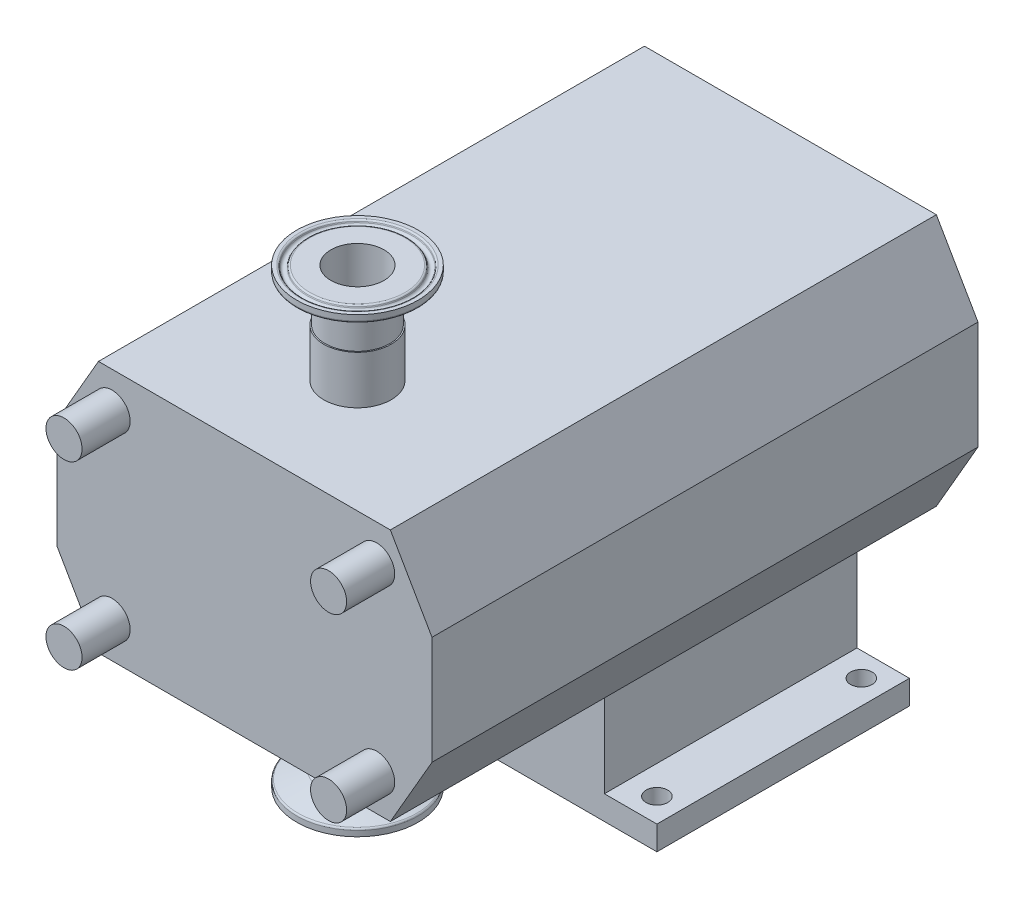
ISO-10303-21;
HEADER;
FILE_DESCRIPTION(('STEP AP214'),'2;1');
FILE_NAME('part.step','',(''),(''),'','','');
FILE_SCHEMA(('AUTOMOTIVE_DESIGN { 1 0 10303 214 1 1 1 1 }'));
ENDSEC;
DATA;
#1=APPLICATION_CONTEXT('core data for automotive mechanical design processes');
#2=APPLICATION_PROTOCOL_DEFINITION('international standard','automotive_design',2000,#1);
#3=PRODUCT_CONTEXT('',#1,'mechanical');
#4=PRODUCT('Part','Part','',(#3));
#5=PRODUCT_RELATED_PRODUCT_CATEGORY('part','',(#4));
#6=PRODUCT_DEFINITION_FORMATION('','',#4);
#7=PRODUCT_DEFINITION_CONTEXT('part definition',#1,'design');
#8=PRODUCT_DEFINITION('design','',#6,#7);
#9=PRODUCT_DEFINITION_SHAPE('','',#8);
#10=(LENGTH_UNIT() NAMED_UNIT(*) SI_UNIT(.MILLI.,.METRE.));
#11=(NAMED_UNIT(*) PLANE_ANGLE_UNIT() SI_UNIT($,.RADIAN.));
#12=(NAMED_UNIT(*) SI_UNIT($,.STERADIAN.) SOLID_ANGLE_UNIT());
#13=UNCERTAINTY_MEASURE_WITH_UNIT(LENGTH_MEASURE(1.E-05),#10,'distance_accuracy_value','');
#14=(GEOMETRIC_REPRESENTATION_CONTEXT(3) GLOBAL_UNCERTAINTY_ASSIGNED_CONTEXT((#13)) GLOBAL_UNIT_ASSIGNED_CONTEXT((#10,
#11,#12)) REPRESENTATION_CONTEXT('',''));
#15=CARTESIAN_POINT('',(0.,0.,0.));
#16=DIRECTION('',(0.,0.,1.));
#17=DIRECTION('',(1.,0.,0.));
#18=AXIS2_PLACEMENT_3D('',#15,#16,#17);
#19=CARTESIAN_POINT('',(-25.,0.,241.732657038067));
#20=DIRECTION('',(0.,0.,1.));
#21=DIRECTION('',(1.,0.,0.));
#22=AXIS2_PLACEMENT_3D('',#19,#20,#21);
#23=CYLINDRICAL_SURFACE('',#22,9.5);
#24=CARTESIAN_POINT('',(-25.,0.,-2.));
#25=DIRECTION('',(0.,0.,1.));
#26=DIRECTION('',(1.,0.,0.));
#27=AXIS2_PLACEMENT_3D('',#24,#25,#26);
#28=CIRCLE('',#27,9.5);
#29=CARTESIAN_POINT('',(-15.5,0.,-2.));
#30=VERTEX_POINT('',#29);
#31=EDGE_CURVE('P0_E277',#30,#30,#28,.T.);
#32=ORIENTED_EDGE('',*,*,#31,.F.);
#33=EDGE_LOOP('',(#32));
#34=FACE_BOUND('',#33,.T.);
#35=DIRECTION('',(0.,0.,1.));
#36=VECTOR('',#35,1.);
#37=CARTESIAN_POINT('',(-15.98612181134,2.99999999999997,241.732657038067));
#38=LINE('',#37,#36);
#39=CARTESIAN_POINT('',(-15.98612181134,3.,-42.));
#40=VERTEX_POINT('',#39);
#41=CARTESIAN_POINT('',(-15.98612181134,3.,-22.));
#42=VERTEX_POINT('',#41);
#43=EDGE_CURVE('P0_E178',#40,#42,#38,.T.);
#44=ORIENTED_EDGE('',*,*,#43,.F.);
#45=CARTESIAN_POINT('',(-25.,0.,-42.));
#46=DIRECTION('',(0.,0.,1.));
#47=DIRECTION('',(1.,0.,0.));
#48=AXIS2_PLACEMENT_3D('',#45,#46,#47);
#49=CIRCLE('',#48,9.5);
#50=CARTESIAN_POINT('',(-15.98612181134,-3.,-42.));
#51=VERTEX_POINT('',#50);
#52=EDGE_CURVE('P0_E176',#40,#51,#49,.T.);
#53=ORIENTED_EDGE('',*,*,#52,.T.);
#54=DIRECTION('',(0.,0.,1.));
#55=VECTOR('',#54,1.);
#56=CARTESIAN_POINT('',(-15.98612181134,-3.00000000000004,241.732657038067));
#57=LINE('',#56,#55);
#58=CARTESIAN_POINT('',(-15.98612181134,-3.00000000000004,-22.));
#59=VERTEX_POINT('',#58);
#60=EDGE_CURVE('P0_E39',#59,#51,#57,.F.);
#61=ORIENTED_EDGE('',*,*,#60,.F.);
#62=CARTESIAN_POINT('',(-15.5,0.,-25.));
#63=CARTESIAN_POINT('',(-15.5000006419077,0.16416708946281,-24.9999991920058));
#64=CARTESIAN_POINT('',(-15.5042954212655,0.328342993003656,-24.9864802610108));
#65=CARTESIAN_POINT('',(-15.5210070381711,0.651888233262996,-24.9329071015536));
#66=CARTESIAN_POINT('',(-15.5334255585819,0.811256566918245,-24.8928473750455));
#67=CARTESIAN_POINT('',(-15.5650291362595,1.12047453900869,-24.787682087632));
#68=CARTESIAN_POINT('',(-15.5842035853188,1.2703386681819,-24.7226157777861));
#69=CARTESIAN_POINT('',(-15.6273427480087,1.55702915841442,-24.5694529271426));
#70=CARTESIAN_POINT('',(-15.6513082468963,1.69385337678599,-24.4813526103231));
#71=CARTESIAN_POINT('',(-15.7023324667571,1.95488615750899,-24.2817053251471));
#72=CARTESIAN_POINT('',(-15.7294596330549,2.07862693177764,-24.1695643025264));
#73=CARTESIAN_POINT('',(-15.7833564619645,2.30589485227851,-23.9262834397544));
#74=CARTESIAN_POINT('',(-15.8101260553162,2.4094181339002,-23.7951399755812));
#75=CARTESIAN_POINT('',(-15.8610140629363,2.59586933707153,-23.5135024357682));
#76=CARTESIAN_POINT('',(-15.8850481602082,2.67820924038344,-23.3626023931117));
#77=CARTESIAN_POINT('',(-15.9267127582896,2.81614778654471,-23.0482150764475));
#78=CARTESIAN_POINT('',(-15.9443449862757,2.87175364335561,-22.8847312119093));
#79=CARTESIAN_POINT('',(-15.9704927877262,2.95292728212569,-22.5551021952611));
#80=CARTESIAN_POINT('',(-15.979271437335,2.97936420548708,-22.3891925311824));
#81=CARTESIAN_POINT('',(-15.9874987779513,3.00416514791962,-22.0550782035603));
#82=CARTESIAN_POINT('',(-15.9869500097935,3.00253681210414,-21.8868741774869));
#83=CARTESIAN_POINT('',(-15.9768164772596,2.97193247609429,-21.5601689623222));
#84=CARTESIAN_POINT('',(-15.9675982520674,2.94406576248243,-21.4015505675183));
#85=CARTESIAN_POINT('',(-15.9417605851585,2.86357596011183,-21.0913669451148));
#86=CARTESIAN_POINT('',(-15.9251403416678,2.81095018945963,-20.9398024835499));
#87=CARTESIAN_POINT('',(-15.8860934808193,2.68166168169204,-20.6454054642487));
#88=CARTESIAN_POINT('',(-15.8635843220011,2.60465367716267,-20.5027359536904));
#89=CARTESIAN_POINT('',(-15.8153331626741,2.4290264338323,-20.2319823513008));
#90=CARTESIAN_POINT('',(-15.7895903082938,2.33040148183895,-20.103902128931));
#91=CARTESIAN_POINT('',(-15.7363062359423,2.10891443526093,-19.859697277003));
#92=CARTESIAN_POINT('',(-15.7087370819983,1.98513792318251,-19.7444065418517));
#93=CARTESIAN_POINT('',(-15.6559621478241,1.71966506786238,-19.5360135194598));
#94=CARTESIAN_POINT('',(-15.6307565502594,1.57796734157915,-19.4429129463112));
#95=CARTESIAN_POINT('',(-15.5852743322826,1.27904248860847,-19.2809619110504));
#96=CARTESIAN_POINT('',(-15.5650393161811,1.12169880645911,-19.2123141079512));
#97=CARTESIAN_POINT('',(-15.5320787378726,0.796908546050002,-19.102710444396));
#98=CARTESIAN_POINT('',(-15.5193508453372,0.629465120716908,-19.0617459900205));
#99=CARTESIAN_POINT('',(-15.5032152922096,0.296303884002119,-19.0101010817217));
#100=CARTESIAN_POINT('',(-15.4994604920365,0.130777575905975,-18.9982920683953));
#101=CARTESIAN_POINT('',(-15.5006652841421,-0.199911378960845,-19.0021062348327));
#102=CARTESIAN_POINT('',(-15.5056235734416,-0.365074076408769,-19.017725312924));
#103=CARTESIAN_POINT('',(-15.5234691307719,-0.685969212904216,-19.0750481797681));
#104=CARTESIAN_POINT('',(-15.5361511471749,-0.841834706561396,-19.1160771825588));
#105=CARTESIAN_POINT('',(-15.5679556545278,-1.14442314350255,-19.2222287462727));
#106=CARTESIAN_POINT('',(-15.5870789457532,-1.2911449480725,-19.2873543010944));
#107=CARTESIAN_POINT('',(-15.6303910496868,-1.57531276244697,-19.4416461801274));
#108=CARTESIAN_POINT('',(-15.6546933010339,-1.71244019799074,-19.5313665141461));
#109=CARTESIAN_POINT('',(-15.7055878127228,-1.97006979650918,-19.7316386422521));
#110=CARTESIAN_POINT('',(-15.7321807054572,-2.09056734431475,-19.8421961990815));
#111=CARTESIAN_POINT('',(-15.7860170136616,-2.31658675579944,-20.0863131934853));
#112=CARTESIAN_POINT('',(-15.813243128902,-2.42130400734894,-20.2206231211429));
#113=CARTESIAN_POINT('',(-15.8641405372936,-2.60679013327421,-20.5055000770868));
#114=CARTESIAN_POINT('',(-15.8878118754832,-2.68755931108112,-20.6560668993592));
#115=CARTESIAN_POINT('',(-15.9286607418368,-2.82237097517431,-20.9689238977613));
#116=CARTESIAN_POINT('',(-15.9458617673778,-2.87651039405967,-21.1311690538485));
#117=CARTESIAN_POINT('',(-15.9716606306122,-2.95649944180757,-21.4631296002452));
#118=CARTESIAN_POINT('',(-15.9802618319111,-2.9823601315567,-21.6328420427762));
#119=CARTESIAN_POINT('',(-15.9875316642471,-3.0042524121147,-21.9664938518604));
#120=CARTESIAN_POINT('',(-15.9866406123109,-3.00160628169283,-22.1303379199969));
#121=CARTESIAN_POINT('',(-15.9760989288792,-2.96976166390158,-22.4551233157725));
#122=CARTESIAN_POINT('',(-15.9664487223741,-2.94056446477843,-22.6160647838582));
#123=CARTESIAN_POINT('',(-15.9397869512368,-2.8573397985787,-22.928056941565));
#124=CARTESIAN_POINT('',(-15.9228900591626,-2.80369834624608,-23.0792211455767));
#125=CARTESIAN_POINT('',(-15.8836701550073,-2.67341300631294,-23.3705239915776));
#126=CARTESIAN_POINT('',(-15.8613460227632,-2.59676436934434,-23.5106603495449));
#127=CARTESIAN_POINT('',(-15.8126776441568,-2.4190708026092,-23.781973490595));
#128=CARTESIAN_POINT('',(-15.7862086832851,-2.31717569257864,-23.9125710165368));
#129=CARTESIAN_POINT('',(-15.7327983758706,-2.0933684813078,-24.1552416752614));
#130=CARTESIAN_POINT('',(-15.705856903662,-1.97145098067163,-24.2673097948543));
#131=CARTESIAN_POINT('',(-15.6534511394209,-1.7061326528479,-24.4735138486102));
#132=CARTESIAN_POINT('',(-15.6280668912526,-1.56214764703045,-24.5669207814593));
#133=CARTESIAN_POINT('',(-15.5826524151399,-1.25971894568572,-24.728083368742));
#134=CARTESIAN_POINT('',(-15.5626201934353,-1.10128066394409,-24.7958485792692));
#135=CARTESIAN_POINT('',(-15.531467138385,-0.787271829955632,-24.8991975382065));
#136=CARTESIAN_POINT('',(-15.5197707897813,-0.632450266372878,-24.9368877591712));
#137=CARTESIAN_POINT('',(-15.5040377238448,-0.318421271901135,-24.9872867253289));
#138=CARTESIAN_POINT('',(-15.4999993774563,-0.159214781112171,-25.00000078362));
#139=CARTESIAN_POINT('',(-15.5,0.,-25.));
#140=B_SPLINE_CURVE_WITH_KNOTS('',3,(#62,#63,#64,#65,#66,#67,#68,#69,#70,#71,#72,#73,#74,#75,
#76,#77,#78,#79,#80,#81,#82,#83,#84,#85,#86,#87,#88,#89,#90,#91,#92,#93,#94,#95,#96,#97,#98,#99,
#100,#101,#102,#103,#104,#105,#106,#107,#108,#109,#110,#111,#112,#113,#114,#115,#116,#117,#118,
#119,#120,#121,#122,#123,#124,#125,#126,#127,#128,#129,#130,#131,#132,#133,#134,#135,#136,#137,
#138,#139),.UNSPECIFIED.,.T.,.F.,(4,2,2,2,2,2,2,2,2,2,2,2,2,2,2,2,2,2,2,2,2,2,2,2,2,2,2,2,2,2,2,
2,2,2,2,2,2,2,4),(0.,0.491915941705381,0.983933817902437,1.47518254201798,1.96651184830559,
2.47177433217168,2.97713330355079,3.49529138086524,4.0133095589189,4.51543663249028,
5.01742692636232,5.49910423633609,5.98083373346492,6.46971527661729,6.95872618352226,
7.47049694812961,7.98230723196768,8.49826565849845,9.01406383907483,9.50955937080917,
10.0049808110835,10.487778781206,10.9706367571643,11.4654198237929,11.9603399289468,
12.4753133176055,12.9902801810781,13.5033584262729,14.0162359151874,14.5054301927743,
14.9946007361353,15.4763007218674,15.9581002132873,16.4590917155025,16.9602185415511,
17.4781824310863,17.9959530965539,18.4731312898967,18.9502079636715),.UNSPECIFIED.);
#141=EDGE_CURVE('P0_E11',#42,#59,#140,.T.);
#142=ORIENTED_EDGE('',*,*,#141,.F.);
#143=EDGE_LOOP('',(#44,#53,#61,#142));
#144=FACE_BOUND('',#143,.T.);
#145=ADVANCED_FACE('P0_F17',(#34,#144),#23,.T.);
#146=CARTESIAN_POINT('',(-60.6794919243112,-52.5,227.));
#147=DIRECTION('',(0.,1.,0.));
#148=DIRECTION('',(-1.,0.,0.));
#149=AXIS2_PLACEMENT_3D('',#146,#147,#148);
#150=PLANE('',#149);
#151=CARTESIAN_POINT('',(0.,-52.5,180.));
#152=DIRECTION('',(0.,1.,0.));
#153=DIRECTION('',(-1.,0.,0.));
#154=AXIS2_PLACEMENT_3D('',#151,#152,#153);
#155=CIRCLE('',#154,14.);
#156=CARTESIAN_POINT('',(-14.,-52.5,180.));
#157=VERTEX_POINT('',#156);
#158=EDGE_CURVE('P0_E192',#157,#157,#155,.T.);
#159=ORIENTED_EDGE('',*,*,#158,.T.);
#160=EDGE_LOOP('',(#159));
#161=FACE_BOUND('',#160,.T.);
#162=DIRECTION('',(1.,0.,0.));
#163=VECTOR('',#162,1.);
#164=CARTESIAN_POINT('',(-60.6794919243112,-52.5,0.));
#165=LINE('',#164,#163);
#166=CARTESIAN_POINT('',(-60.6794919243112,-52.5,0.));
#167=VERTEX_POINT('',#166);
#168=CARTESIAN_POINT('',(60.6794919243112,-52.5,0.));
#169=VERTEX_POINT('',#168);
#170=EDGE_CURVE('P0_E337',#167,#169,#165,.T.);
#171=ORIENTED_EDGE('',*,*,#170,.T.);
#172=DIRECTION('',(0.,0.,-1.));
#173=VECTOR('',#172,1.);
#174=CARTESIAN_POINT('',(60.6794919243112,-52.5,227.));
#175=LINE('',#174,#173);
#176=CARTESIAN_POINT('',(60.6794919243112,-52.5,227.));
#177=VERTEX_POINT('',#176);
#178=EDGE_CURVE('P0_E347',#177,#169,#175,.T.);
#179=ORIENTED_EDGE('',*,*,#178,.F.);
#180=DIRECTION('',(1.,0.,0.));
#181=VECTOR('',#180,1.);
#182=CARTESIAN_POINT('',(-60.6794919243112,-52.5,227.));
#183=LINE('',#182,#181);
#184=CARTESIAN_POINT('',(-60.6794919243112,-52.5,227.));
#185=VERTEX_POINT('',#184);
#186=EDGE_CURVE('P0_E320',#185,#177,#183,.T.);
#187=ORIENTED_EDGE('',*,*,#186,.F.);
#188=DIRECTION('',(0.,0.,-1.));
#189=VECTOR('',#188,1.);
#190=CARTESIAN_POINT('',(-60.6794919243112,-52.5,227.));
#191=LINE('',#190,#189);
#192=EDGE_CURVE('P0_E350',#185,#167,#191,.T.);
#193=ORIENTED_EDGE('',*,*,#192,.T.);
#194=EDGE_LOOP('',(#171,#179,#187,#193));
#195=FACE_BOUND('',#194,.T.);
#196=DIRECTION('',(1.,0.,0.));
#197=VECTOR('',#196,1.);
#198=CARTESIAN_POINT('',(45.6794919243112,-52.5,18.));
#199=LINE('',#198,#197);
#200=CARTESIAN_POINT('',(-45.6794919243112,-52.5,18.));
#201=VERTEX_POINT('',#200);
#202=CARTESIAN_POINT('',(45.6794919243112,-52.5,18.));
#203=VERTEX_POINT('',#202);
#204=EDGE_CURVE('P0_E220',#201,#203,#199,.T.);
#205=ORIENTED_EDGE('',*,*,#204,.F.);
#206=DIRECTION('',(0.,0.,1.));
#207=VECTOR('',#206,1.);
#208=CARTESIAN_POINT('',(-45.6794919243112,-52.5,18.));
#209=LINE('',#208,#207);
#210=CARTESIAN_POINT('',(-45.6794919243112,-52.5,123.));
#211=VERTEX_POINT('',#210);
#212=EDGE_CURVE('P0_E238',#201,#211,#209,.T.);
#213=ORIENTED_EDGE('',*,*,#212,.T.);
#214=DIRECTION('',(1.,0.,0.));
#215=VECTOR('',#214,1.);
#216=CARTESIAN_POINT('',(45.6794919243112,-52.5,123.));
#217=LINE('',#216,#215);
#218=CARTESIAN_POINT('',(45.6794919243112,-52.5,123.));
#219=VERTEX_POINT('',#218);
#220=EDGE_CURVE('P0_E219',#211,#219,#217,.T.);
#221=ORIENTED_EDGE('',*,*,#220,.T.);
#222=DIRECTION('',(0.,0.,1.));
#223=VECTOR('',#222,1.);
#224=CARTESIAN_POINT('',(45.6794919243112,-52.5,18.));
#225=LINE('',#224,#223);
#226=EDGE_CURVE('P0_E274',#203,#219,#225,.T.);
#227=ORIENTED_EDGE('',*,*,#226,.F.);
#228=EDGE_LOOP('',(#205,#213,#221,#227));
#229=FACE_BOUND('',#228,.T.);
#230=ADVANCED_FACE('P0_F393',(#161,#195,#229),#150,.F.);
#231=CARTESIAN_POINT('',(90.9903810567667,0.,0.));
#232=DIRECTION('',(0.,0.,1.));
#233=DIRECTION('',(1.,0.,0.));
#234=AXIS2_PLACEMENT_3D('',#231,#232,#233);
#235=PLANE('',#234);
#236=DIRECTION('',(-0.500000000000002,0.866025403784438,0.));
#237=VECTOR('',#236,1.);
#238=CARTESIAN_POINT('',(60.6794919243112,52.5,0.));
#239=LINE('',#238,#237);
#240=CARTESIAN_POINT('',(78.,22.5,0.));
#241=VERTEX_POINT('',#240);
#242=CARTESIAN_POINT('',(60.6794919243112,52.5,0.));
#243=VERTEX_POINT('',#242);
#244=EDGE_CURVE('P0_E305',#241,#243,#239,.T.);
#245=ORIENTED_EDGE('',*,*,#244,.F.);
#246=DIRECTION('',(0.,1.,0.));
#247=VECTOR('',#246,1.);
#248=CARTESIAN_POINT('',(78.,22.5,0.));
#249=LINE('',#248,#247);
#250=CARTESIAN_POINT('',(78.,-22.5,0.));
#251=VERTEX_POINT('',#250);
#252=EDGE_CURVE('P0_E312',#251,#241,#249,.T.);
#253=ORIENTED_EDGE('',*,*,#252,.F.);
#254=DIRECTION('',(0.500000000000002,0.866025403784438,0.));
#255=VECTOR('',#254,1.);
#256=CARTESIAN_POINT('',(60.6794919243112,-52.5,0.));
#257=LINE('',#256,#255);
#258=EDGE_CURVE('P0_E339',#169,#251,#257,.T.);
#259=ORIENTED_EDGE('',*,*,#258,.F.);
#260=ORIENTED_EDGE('',*,*,#170,.F.);
#261=DIRECTION('',(0.500000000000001,-0.866025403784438,0.));
#262=VECTOR('',#261,1.);
#263=CARTESIAN_POINT('',(-60.6794919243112,-52.5,0.));
#264=LINE('',#263,#262);
#265=CARTESIAN_POINT('',(-78.,-22.5,0.));
#266=VERTEX_POINT('',#265);
#267=EDGE_CURVE('P0_E335',#266,#167,#264,.T.);
#268=ORIENTED_EDGE('',*,*,#267,.F.);
#269=DIRECTION('',(0.,-1.,0.));
#270=VECTOR('',#269,1.);
#271=CARTESIAN_POINT('',(-78.,22.5,0.));
#272=LINE('',#271,#270);
#273=CARTESIAN_POINT('',(-78.,22.5,0.));
#274=VERTEX_POINT('',#273);
#275=EDGE_CURVE('P0_E333',#274,#266,#272,.T.);
#276=ORIENTED_EDGE('',*,*,#275,.F.);
#277=DIRECTION('',(-0.500000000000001,-0.866025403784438,0.));
#278=VECTOR('',#277,1.);
#279=CARTESIAN_POINT('',(-60.6794919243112,52.5,0.));
#280=LINE('',#279,#278);
#281=CARTESIAN_POINT('',(-60.6794919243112,52.5,0.));
#282=VERTEX_POINT('',#281);
#283=EDGE_CURVE('P0_E331',#282,#274,#280,.T.);
#284=ORIENTED_EDGE('',*,*,#283,.F.);
#285=DIRECTION('',(-1.,0.,0.));
#286=VECTOR('',#285,1.);
#287=CARTESIAN_POINT('',(-60.6794919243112,52.5,0.));
#288=LINE('',#287,#286);
#289=EDGE_CURVE('P0_E329',#243,#282,#288,.T.);
#290=ORIENTED_EDGE('',*,*,#289,.F.);
#291=EDGE_LOOP('',(#245,#253,#259,#260,#268,#276,#284,#290));
#292=FACE_BOUND('',#291,.T.);
#293=CARTESIAN_POINT('',(-25.,0.,0.));
#294=DIRECTION('',(0.,0.,1.));
#295=DIRECTION('',(1.,0.,0.));
#296=AXIS2_PLACEMENT_3D('',#293,#294,#295);
#297=CIRCLE('',#296,12.5);
#298=CARTESIAN_POINT('',(-12.5,0.,0.));
#299=VERTEX_POINT('',#298);
#300=EDGE_CURVE('P0_E29',#299,#299,#297,.F.);
#301=ORIENTED_EDGE('',*,*,#300,.F.);
#302=EDGE_LOOP('',(#301));
#303=FACE_BOUND('',#302,.T.);
#304=ADVANCED_FACE('P0_F399',(#292,#303),#235,.F.);
#305=CARTESIAN_POINT('',(90.9903810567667,0.,227.));
#306=DIRECTION('',(0.,0.,1.));
#307=DIRECTION('',(1.,0.,0.));
#308=AXIS2_PLACEMENT_3D('',#305,#306,#307);
#309=PLANE('',#308);
#310=CARTESIAN_POINT('',(55.,-37.5,227.));
#311=DIRECTION('',(0.,0.,1.));
#312=DIRECTION('',(1.,0.,0.));
#313=AXIS2_PLACEMENT_3D('',#310,#311,#312);
#314=CIRCLE('',#313,7.49999999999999);
#315=CARTESIAN_POINT('',(62.5,-37.5,227.));
#316=VERTEX_POINT('',#315);
#317=EDGE_CURVE('P0_E287',#316,#316,#314,.T.);
#318=ORIENTED_EDGE('',*,*,#317,.F.);
#319=EDGE_LOOP('',(#318));
#320=FACE_BOUND('',#319,.T.);
#321=CARTESIAN_POINT('',(-55.,37.5,227.));
#322=DIRECTION('',(0.,0.,1.));
#323=DIRECTION('',(1.,0.,0.));
#324=AXIS2_PLACEMENT_3D('',#321,#322,#323);
#325=CIRCLE('',#324,7.5);
#326=CARTESIAN_POINT('',(-47.5,37.5,227.));
#327=VERTEX_POINT('',#326);
#328=EDGE_CURVE('P0_E299',#327,#327,#325,.T.);
#329=ORIENTED_EDGE('',*,*,#328,.F.);
#330=EDGE_LOOP('',(#329));
#331=FACE_BOUND('',#330,.T.);
#332=DIRECTION('',(-0.500000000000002,0.866025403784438,0.));
#333=VECTOR('',#332,1.);
#334=CARTESIAN_POINT('',(60.6794919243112,52.5,227.));
#335=LINE('',#334,#333);
#336=CARTESIAN_POINT('',(78.,22.5,227.));
#337=VERTEX_POINT('',#336);
#338=CARTESIAN_POINT('',(60.6794919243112,52.5,227.));
#339=VERTEX_POINT('',#338);
#340=EDGE_CURVE('P0_E308',#337,#339,#335,.T.);
#341=ORIENTED_EDGE('',*,*,#340,.T.);
#342=DIRECTION('',(-1.,0.,0.));
#343=VECTOR('',#342,1.);
#344=CARTESIAN_POINT('',(-60.6794919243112,52.5,227.));
#345=LINE('',#344,#343);
#346=CARTESIAN_POINT('',(-60.6794919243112,52.5,227.));
#347=VERTEX_POINT('',#346);
#348=EDGE_CURVE('P0_E311',#339,#347,#345,.T.);
#349=ORIENTED_EDGE('',*,*,#348,.T.);
#350=DIRECTION('',(-0.500000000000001,-0.866025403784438,0.));
#351=VECTOR('',#350,1.);
#352=CARTESIAN_POINT('',(-60.6794919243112,52.5,227.));
#353=LINE('',#352,#351);
#354=CARTESIAN_POINT('',(-78.,22.5,227.));
#355=VERTEX_POINT('',#354);
#356=EDGE_CURVE('P0_E314',#347,#355,#353,.T.);
#357=ORIENTED_EDGE('',*,*,#356,.T.);
#358=DIRECTION('',(0.,-1.,0.));
#359=VECTOR('',#358,1.);
#360=CARTESIAN_POINT('',(-78.,22.5,227.));
#361=LINE('',#360,#359);
#362=CARTESIAN_POINT('',(-78.,-22.5,227.));
#363=VERTEX_POINT('',#362);
#364=EDGE_CURVE('P0_E316',#355,#363,#361,.T.);
#365=ORIENTED_EDGE('',*,*,#364,.T.);
#366=DIRECTION('',(0.500000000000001,-0.866025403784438,0.));
#367=VECTOR('',#366,1.);
#368=CARTESIAN_POINT('',(-60.6794919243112,-52.5,227.));
#369=LINE('',#368,#367);
#370=EDGE_CURVE('P0_E318',#363,#185,#369,.T.);
#371=ORIENTED_EDGE('',*,*,#370,.T.);
#372=ORIENTED_EDGE('',*,*,#186,.T.);
#373=DIRECTION('',(0.500000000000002,0.866025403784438,0.));
#374=VECTOR('',#373,1.);
#375=CARTESIAN_POINT('',(60.6794919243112,-52.5,227.));
#376=LINE('',#375,#374);
#377=CARTESIAN_POINT('',(78.,-22.5,227.));
#378=VERTEX_POINT('',#377);
#379=EDGE_CURVE('P0_E322',#177,#378,#376,.T.);
#380=ORIENTED_EDGE('',*,*,#379,.T.);
#381=DIRECTION('',(0.,1.,0.));
#382=VECTOR('',#381,1.);
#383=CARTESIAN_POINT('',(78.,22.5,227.));
#384=LINE('',#383,#382);
#385=EDGE_CURVE('P0_E324',#378,#337,#384,.T.);
#386=ORIENTED_EDGE('',*,*,#385,.T.);
#387=EDGE_LOOP('',(#341,#349,#357,#365,#371,#372,#380,#386));
#388=FACE_BOUND('',#387,.T.);
#389=CARTESIAN_POINT('',(55.,37.5,227.));
#390=DIRECTION('',(0.,0.,1.));
#391=DIRECTION('',(1.,0.,0.));
#392=AXIS2_PLACEMENT_3D('',#389,#390,#391);
#393=CIRCLE('',#392,7.49999999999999);
#394=CARTESIAN_POINT('',(62.5,37.5,227.));
#395=VERTEX_POINT('',#394);
#396=EDGE_CURVE('P0_E293',#395,#395,#393,.T.);
#397=ORIENTED_EDGE('',*,*,#396,.F.);
#398=EDGE_LOOP('',(#397));
#399=FACE_BOUND('',#398,.T.);
#400=CARTESIAN_POINT('',(-55.,-37.5,227.));
#401=DIRECTION('',(0.,0.,1.));
#402=DIRECTION('',(1.,0.,0.));
#403=AXIS2_PLACEMENT_3D('',#400,#401,#402);
#404=CIRCLE('',#403,7.5);
#405=CARTESIAN_POINT('',(-47.5,-37.5,227.));
#406=VERTEX_POINT('',#405);
#407=EDGE_CURVE('P0_E283',#406,#406,#404,.T.);
#408=ORIENTED_EDGE('',*,*,#407,.F.);
#409=EDGE_LOOP('',(#408));
#410=FACE_BOUND('',#409,.T.);
#411=ADVANCED_FACE('P0_F448',(#320,#331,#388,#399,#410),#309,.T.);
#412=CARTESIAN_POINT('',(60.6794919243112,52.5,227.));
#413=DIRECTION('',(-0.866025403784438,-0.500000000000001,0.));
#414=DIRECTION('',(0.500000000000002,-0.866025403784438,0.));
#415=AXIS2_PLACEMENT_3D('',#412,#413,#414);
#416=PLANE('',#415);
#417=ORIENTED_EDGE('',*,*,#244,.T.);
#418=DIRECTION('',(0.,0.,-1.));
#419=VECTOR('',#418,1.);
#420=CARTESIAN_POINT('',(60.6794919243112,52.5,227.));
#421=LINE('',#420,#419);
#422=EDGE_CURVE('P0_E362',#339,#243,#421,.T.);
#423=ORIENTED_EDGE('',*,*,#422,.F.);
#424=ORIENTED_EDGE('',*,*,#340,.F.);
#425=DIRECTION('',(0.,0.,-1.));
#426=VECTOR('',#425,1.);
#427=CARTESIAN_POINT('',(78.,22.5,227.));
#428=LINE('',#427,#426);
#429=EDGE_CURVE('P0_E326',#337,#241,#428,.T.);
#430=ORIENTED_EDGE('',*,*,#429,.T.);
#431=EDGE_LOOP('',(#417,#423,#424,#430));
#432=FACE_BOUND('',#431,.T.);
#433=ADVANCED_FACE('P0_F19',(#432),#416,.F.);
#434=CARTESIAN_POINT('',(-60.6794919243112,52.5,227.));
#435=DIRECTION('',(0.,-1.,0.));
#436=DIRECTION('',(1.,0.,0.));
#437=AXIS2_PLACEMENT_3D('',#434,#435,#436);
#438=PLANE('',#437);
#439=CARTESIAN_POINT('',(0.,52.5,180.));
#440=DIRECTION('',(0.,-1.,0.));
#441=DIRECTION('',(1.,0.,0.));
#442=AXIS2_PLACEMENT_3D('',#439,#440,#441);
#443=CIRCLE('',#442,14.);
#444=CARTESIAN_POINT('',(14.,52.5,180.));
#445=VERTEX_POINT('',#444);
#446=EDGE_CURVE('P0_E191',#445,#445,#443,.T.);
#447=ORIENTED_EDGE('',*,*,#446,.T.);
#448=EDGE_LOOP('',(#447));
#449=FACE_BOUND('',#448,.T.);
#450=ORIENTED_EDGE('',*,*,#289,.T.);
#451=DIRECTION('',(0.,0.,-1.));
#452=VECTOR('',#451,1.);
#453=CARTESIAN_POINT('',(-60.6794919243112,52.5,227.));
#454=LINE('',#453,#452);
#455=EDGE_CURVE('P0_E359',#347,#282,#454,.T.);
#456=ORIENTED_EDGE('',*,*,#455,.F.);
#457=ORIENTED_EDGE('',*,*,#348,.F.);
#458=ORIENTED_EDGE('',*,*,#422,.T.);
#459=EDGE_LOOP('',(#450,#456,#457,#458));
#460=FACE_BOUND('',#459,.T.);
#461=ADVANCED_FACE('P0_F369',(#449,#460),#438,.F.);
#462=CARTESIAN_POINT('',(-60.6794919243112,52.5,227.));
#463=DIRECTION('',(0.866025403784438,-0.500000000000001,0.));
#464=DIRECTION('',(0.500000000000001,0.866025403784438,0.));
#465=AXIS2_PLACEMENT_3D('',#462,#463,#464);
#466=PLANE('',#465);
#467=ORIENTED_EDGE('',*,*,#283,.T.);
#468=DIRECTION('',(0.,0.,-1.));
#469=VECTOR('',#468,1.);
#470=CARTESIAN_POINT('',(-78.,22.5,227.));
#471=LINE('',#470,#469);
#472=EDGE_CURVE('P0_E356',#355,#274,#471,.T.);
#473=ORIENTED_EDGE('',*,*,#472,.F.);
#474=ORIENTED_EDGE('',*,*,#356,.F.);
#475=ORIENTED_EDGE('',*,*,#455,.T.);
#476=EDGE_LOOP('',(#467,#473,#474,#475));
#477=FACE_BOUND('',#476,.T.);
#478=ADVANCED_FACE('P0_F469',(#477),#466,.F.);
#479=CARTESIAN_POINT('',(-78.,22.5,227.));
#480=DIRECTION('',(1.,0.,0.));
#481=DIRECTION('',(0.,0.,-1.));
#482=AXIS2_PLACEMENT_3D('',#479,#480,#481);
#483=PLANE('',#482);
#484=ORIENTED_EDGE('',*,*,#275,.T.);
#485=DIRECTION('',(0.,0.,-1.));
#486=VECTOR('',#485,1.);
#487=CARTESIAN_POINT('',(-78.,-22.5,227.));
#488=LINE('',#487,#486);
#489=EDGE_CURVE('P0_E353',#363,#266,#488,.T.);
#490=ORIENTED_EDGE('',*,*,#489,.F.);
#491=ORIENTED_EDGE('',*,*,#364,.F.);
#492=ORIENTED_EDGE('',*,*,#472,.T.);
#493=EDGE_LOOP('',(#484,#490,#491,#492));
#494=FACE_BOUND('',#493,.T.);
#495=ADVANCED_FACE('P0_F465',(#494),#483,.F.);
#496=CARTESIAN_POINT('',(-60.6794919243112,-52.5,227.));
#497=DIRECTION('',(0.866025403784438,0.500000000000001,0.));
#498=DIRECTION('',(-0.500000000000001,0.866025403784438,0.));
#499=AXIS2_PLACEMENT_3D('',#496,#497,#498);
#500=PLANE('',#499);
#501=ORIENTED_EDGE('',*,*,#267,.T.);
#502=ORIENTED_EDGE('',*,*,#192,.F.);
#503=ORIENTED_EDGE('',*,*,#370,.F.);
#504=ORIENTED_EDGE('',*,*,#489,.T.);
#505=EDGE_LOOP('',(#501,#502,#503,#504));
#506=FACE_BOUND('',#505,.T.);
#507=ADVANCED_FACE('P0_F460',(#506),#500,.F.);
#508=CARTESIAN_POINT('',(60.6794919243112,-52.5,227.));
#509=DIRECTION('',(-0.866025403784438,0.500000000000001,0.));
#510=DIRECTION('',(-0.500000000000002,-0.866025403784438,0.));
#511=AXIS2_PLACEMENT_3D('',#508,#509,#510);
#512=PLANE('',#511);
#513=ORIENTED_EDGE('',*,*,#258,.T.);
#514=DIRECTION('',(0.,0.,-1.));
#515=VECTOR('',#514,1.);
#516=CARTESIAN_POINT('',(78.,-22.5,227.));
#517=LINE('',#516,#515);
#518=EDGE_CURVE('P0_E344',#378,#251,#517,.T.);
#519=ORIENTED_EDGE('',*,*,#518,.F.);
#520=ORIENTED_EDGE('',*,*,#379,.F.);
#521=ORIENTED_EDGE('',*,*,#178,.T.);
#522=EDGE_LOOP('',(#513,#519,#520,#521));
#523=FACE_BOUND('',#522,.T.);
#524=ADVANCED_FACE('P0_F457',(#523),#512,.F.);
#525=CARTESIAN_POINT('',(78.,22.5,227.));
#526=DIRECTION('',(-1.,0.,0.));
#527=DIRECTION('',(0.,0.,1.));
#528=AXIS2_PLACEMENT_3D('',#525,#526,#527);
#529=PLANE('',#528);
#530=ORIENTED_EDGE('',*,*,#252,.T.);
#531=ORIENTED_EDGE('',*,*,#429,.F.);
#532=ORIENTED_EDGE('',*,*,#385,.F.);
#533=ORIENTED_EDGE('',*,*,#518,.T.);
#534=EDGE_LOOP('',(#530,#531,#532,#533));
#535=FACE_BOUND('',#534,.T.);
#536=ADVANCED_FACE('P0_F446',(#535),#529,.F.);
#537=CARTESIAN_POINT('',(-55.,37.5,247.));
#538=DIRECTION('',(0.,0.,-1.));
#539=DIRECTION('',(-1.,0.,0.));
#540=AXIS2_PLACEMENT_3D('',#537,#538,#539);
#541=CYLINDRICAL_SURFACE('',#540,7.5);
#542=CARTESIAN_POINT('',(-55.,37.5,247.));
#543=DIRECTION('',(0.,0.,1.));
#544=DIRECTION('',(1.,0.,0.));
#545=AXIS2_PLACEMENT_3D('',#542,#543,#544);
#546=CIRCLE('',#545,7.5);
#547=CARTESIAN_POINT('',(-47.5,37.5,247.));
#548=VERTEX_POINT('',#547);
#549=EDGE_CURVE('P0_E302',#548,#548,#546,.T.);
#550=ORIENTED_EDGE('',*,*,#549,.F.);
#551=EDGE_LOOP('',(#550));
#552=FACE_BOUND('',#551,.T.);
#553=ORIENTED_EDGE('',*,*,#328,.T.);
#554=EDGE_LOOP('',(#553));
#555=FACE_BOUND('',#554,.T.);
#556=ADVANCED_FACE('P0_F442',(#552,#555),#541,.T.);
#557=CARTESIAN_POINT('',(-55.,37.5,247.));
#558=DIRECTION('',(0.,0.,1.));
#559=DIRECTION('',(1.,0.,0.));
#560=AXIS2_PLACEMENT_3D('',#557,#558,#559);
#561=PLANE('',#560);
#562=ORIENTED_EDGE('',*,*,#549,.T.);
#563=EDGE_LOOP('',(#562));
#564=FACE_BOUND('',#563,.T.);
#565=ADVANCED_FACE('P0_F438',(#564),#561,.T.);
#566=CARTESIAN_POINT('',(55.,37.5,247.));
#567=DIRECTION('',(0.,0.,-1.));
#568=DIRECTION('',(-1.,0.,0.));
#569=AXIS2_PLACEMENT_3D('',#566,#567,#568);
#570=CYLINDRICAL_SURFACE('',#569,7.49999999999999);
#571=CARTESIAN_POINT('',(55.,37.5,247.));
#572=DIRECTION('',(0.,0.,1.));
#573=DIRECTION('',(1.,0.,0.));
#574=AXIS2_PLACEMENT_3D('',#571,#572,#573);
#575=CIRCLE('',#574,7.49999999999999);
#576=CARTESIAN_POINT('',(62.5,37.5,247.));
#577=VERTEX_POINT('',#576);
#578=EDGE_CURVE('P0_E296',#577,#577,#575,.T.);
#579=ORIENTED_EDGE('',*,*,#578,.F.);
#580=EDGE_LOOP('',(#579));
#581=FACE_BOUND('',#580,.T.);
#582=ORIENTED_EDGE('',*,*,#396,.T.);
#583=EDGE_LOOP('',(#582));
#584=FACE_BOUND('',#583,.T.);
#585=ADVANCED_FACE('P0_F434',(#581,#584),#570,.T.);
#586=CARTESIAN_POINT('',(55.,37.5,247.));
#587=DIRECTION('',(0.,0.,1.));
#588=DIRECTION('',(1.,0.,0.));
#589=AXIS2_PLACEMENT_3D('',#586,#587,#588);
#590=PLANE('',#589);
#591=ORIENTED_EDGE('',*,*,#578,.T.);
#592=EDGE_LOOP('',(#591));
#593=FACE_BOUND('',#592,.T.);
#594=ADVANCED_FACE('P0_F430',(#593),#590,.T.);
#595=CARTESIAN_POINT('',(55.,-37.5,247.));
#596=DIRECTION('',(0.,0.,-1.));
#597=DIRECTION('',(-1.,0.,0.));
#598=AXIS2_PLACEMENT_3D('',#595,#596,#597);
#599=CYLINDRICAL_SURFACE('',#598,7.49999999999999);
#600=CARTESIAN_POINT('',(55.,-37.5,247.));
#601=DIRECTION('',(0.,0.,1.));
#602=DIRECTION('',(1.,0.,0.));
#603=AXIS2_PLACEMENT_3D('',#600,#601,#602);
#604=CIRCLE('',#603,7.49999999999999);
#605=CARTESIAN_POINT('',(62.5,-37.5,247.));
#606=VERTEX_POINT('',#605);
#607=EDGE_CURVE('P0_E290',#606,#606,#604,.T.);
#608=ORIENTED_EDGE('',*,*,#607,.F.);
#609=EDGE_LOOP('',(#608));
#610=FACE_BOUND('',#609,.T.);
#611=ORIENTED_EDGE('',*,*,#317,.T.);
#612=EDGE_LOOP('',(#611));
#613=FACE_BOUND('',#612,.T.);
#614=ADVANCED_FACE('P0_F426',(#610,#613),#599,.T.);
#615=CARTESIAN_POINT('',(55.,-37.5,247.));
#616=DIRECTION('',(0.,0.,1.));
#617=DIRECTION('',(1.,0.,0.));
#618=AXIS2_PLACEMENT_3D('',#615,#616,#617);
#619=PLANE('',#618);
#620=ORIENTED_EDGE('',*,*,#607,.T.);
#621=EDGE_LOOP('',(#620));
#622=FACE_BOUND('',#621,.T.);
#623=ADVANCED_FACE('P0_F422',(#622),#619,.T.);
#624=CARTESIAN_POINT('',(-55.,-37.5,247.));
#625=DIRECTION('',(0.,0.,-1.));
#626=DIRECTION('',(-1.,0.,0.));
#627=AXIS2_PLACEMENT_3D('',#624,#625,#626);
#628=CYLINDRICAL_SURFACE('',#627,7.5);
#629=CARTESIAN_POINT('',(-55.,-37.5,247.));
#630=DIRECTION('',(0.,0.,1.));
#631=DIRECTION('',(1.,0.,0.));
#632=AXIS2_PLACEMENT_3D('',#629,#630,#631);
#633=CIRCLE('',#632,7.5);
#634=CARTESIAN_POINT('',(-47.5,-37.5,247.));
#635=VERTEX_POINT('',#634);
#636=EDGE_CURVE('P0_E284',#635,#635,#633,.T.);
#637=ORIENTED_EDGE('',*,*,#636,.F.);
#638=EDGE_LOOP('',(#637));
#639=FACE_BOUND('',#638,.T.);
#640=ORIENTED_EDGE('',*,*,#407,.T.);
#641=EDGE_LOOP('',(#640));
#642=FACE_BOUND('',#641,.T.);
#643=ADVANCED_FACE('P0_F418',(#639,#642),#628,.T.);
#644=CARTESIAN_POINT('',(-55.,-37.5,247.));
#645=DIRECTION('',(0.,0.,1.));
#646=DIRECTION('',(1.,0.,0.));
#647=AXIS2_PLACEMENT_3D('',#644,#645,#646);
#648=PLANE('',#647);
#649=ORIENTED_EDGE('',*,*,#636,.T.);
#650=EDGE_LOOP('',(#649));
#651=FACE_BOUND('',#650,.T.);
#652=ADVANCED_FACE('P0_F414',(#651),#648,.T.);
#653=CARTESIAN_POINT('',(-25.,0.,241.732657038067));
#654=DIRECTION('',(0.,0.,1.));
#655=DIRECTION('',(1.,0.,0.));
#656=AXIS2_PLACEMENT_3D('',#653,#654,#655);
#657=CYLINDRICAL_SURFACE('',#656,12.5);
#658=ORIENTED_EDGE('',*,*,#300,.T.);
#659=EDGE_LOOP('',(#658));
#660=FACE_BOUND('',#659,.T.);
#661=CARTESIAN_POINT('',(-25.,0.,-2.));
#662=DIRECTION('',(0.,0.,1.));
#663=DIRECTION('',(1.,0.,0.));
#664=AXIS2_PLACEMENT_3D('',#661,#662,#663);
#665=CIRCLE('',#664,12.5);
#666=CARTESIAN_POINT('',(-12.5,0.,-2.));
#667=VERTEX_POINT('',#666);
#668=EDGE_CURVE('P0_E280',#667,#667,#665,.T.);
#669=ORIENTED_EDGE('',*,*,#668,.T.);
#670=EDGE_LOOP('',(#669));
#671=FACE_BOUND('',#670,.T.);
#672=ADVANCED_FACE('P0_F410',(#660,#671),#657,.T.);
#673=CARTESIAN_POINT('',(-25.,12.5,-2.));
#674=DIRECTION('',(0.,0.,1.));
#675=DIRECTION('',(1.,0.,0.));
#676=AXIS2_PLACEMENT_3D('',#673,#674,#675);
#677=PLANE('',#676);
#678=ORIENTED_EDGE('',*,*,#668,.F.);
#679=EDGE_LOOP('',(#678));
#680=FACE_BOUND('',#679,.T.);
#681=ORIENTED_EDGE('',*,*,#31,.T.);
#682=EDGE_LOOP('',(#681));
#683=FACE_BOUND('',#682,.T.);
#684=ADVANCED_FACE('P0_F407',(#680,#683),#677,.F.);
#685=CARTESIAN_POINT('',(-25.,9.5,-42.));
#686=DIRECTION('',(0.,0.,1.));
#687=DIRECTION('',(1.,0.,0.));
#688=AXIS2_PLACEMENT_3D('',#685,#686,#687);
#689=PLANE('',#688);
#690=ORIENTED_EDGE('',*,*,#52,.F.);
#691=DIRECTION('',(-1.,0.,0.));
#692=VECTOR('',#691,1.);
#693=CARTESIAN_POINT('',(-12.9,3.,-42.));
#694=LINE('',#693,#692);
#695=CARTESIAN_POINT('',(-12.9,3.,-42.));
#696=VERTEX_POINT('',#695);
#697=EDGE_CURVE('P0_E158',#696,#40,#694,.T.);
#698=ORIENTED_EDGE('',*,*,#697,.F.);
#699=DIRECTION('',(0.,1.,0.));
#700=VECTOR('',#699,1.);
#701=CARTESIAN_POINT('',(-12.9,3.,-42.));
#702=LINE('',#701,#700);
#703=CARTESIAN_POINT('',(-12.9,-3.,-42.));
#704=VERTEX_POINT('',#703);
#705=EDGE_CURVE('P0_E164',#704,#696,#702,.T.);
#706=ORIENTED_EDGE('',*,*,#705,.F.);
#707=DIRECTION('',(-1.,0.,0.));
#708=VECTOR('',#707,1.);
#709=CARTESIAN_POINT('',(-12.9,-3.,-42.));
#710=LINE('',#709,#708);
#711=EDGE_CURVE('P0_E768',#704,#51,#710,.T.);
#712=ORIENTED_EDGE('',*,*,#711,.T.);
#713=EDGE_LOOP('',(#690,#698,#706,#712));
#714=FACE_BOUND('',#713,.T.);
#715=ADVANCED_FACE('P0_F175',(#714),#689,.F.);
#716=CARTESIAN_POINT('',(45.6794919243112,-52.5,18.));
#717=DIRECTION('',(-1.,0.,0.));
#718=DIRECTION('',(0.,-1.,0.));
#719=AXIS2_PLACEMENT_3D('',#716,#717,#718);
#720=PLANE('',#719);
#721=DIRECTION('',(0.,-1.,0.));
#722=VECTOR('',#721,1.);
#723=CARTESIAN_POINT('',(45.6794919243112,-52.5,123.));
#724=LINE('',#723,#722);
#725=CARTESIAN_POINT('',(45.6794919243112,-102.,123.));
#726=VERTEX_POINT('',#725);
#727=EDGE_CURVE('P0_E241',#219,#726,#724,.T.);
#728=ORIENTED_EDGE('',*,*,#727,.T.);
#729=DIRECTION('',(0.,0.,1.));
#730=VECTOR('',#729,1.);
#731=CARTESIAN_POINT('',(45.6794919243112,-102.,18.));
#732=LINE('',#731,#730);
#733=CARTESIAN_POINT('',(45.6794919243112,-102.,18.));
#734=VERTEX_POINT('',#733);
#735=EDGE_CURVE('P0_E271',#734,#726,#732,.T.);
#736=ORIENTED_EDGE('',*,*,#735,.F.);
#737=DIRECTION('',(0.,-1.,0.));
#738=VECTOR('',#737,1.);
#739=CARTESIAN_POINT('',(45.6794919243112,-52.5,18.));
#740=LINE('',#739,#738);
#741=EDGE_CURVE('P0_E223',#203,#734,#740,.T.);
#742=ORIENTED_EDGE('',*,*,#741,.F.);
#743=ORIENTED_EDGE('',*,*,#226,.T.);
#744=EDGE_LOOP('',(#728,#736,#742,#743));
#745=FACE_BOUND('',#744,.T.);
#746=ADVANCED_FACE('P0_F529',(#745),#720,.F.);
#747=CARTESIAN_POINT('',(45.6794919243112,-102.,18.));
#748=DIRECTION('',(0.,-1.,0.));
#749=DIRECTION('',(1.,0.,0.));
#750=AXIS2_PLACEMENT_3D('',#747,#748,#749);
#751=PLANE('',#750);
#752=CARTESIAN_POINT('',(57.5,-102.,28.));
#753=DIRECTION('',(0.,-1.,0.));
#754=DIRECTION('',(1.,0.,0.));
#755=AXIS2_PLACEMENT_3D('',#752,#753,#754);
#756=CIRCLE('',#755,4.5);
#757=CARTESIAN_POINT('',(62.,-102.,28.));
#758=VERTEX_POINT('',#757);
#759=EDGE_CURVE('P0_E207',#758,#758,#756,.F.);
#760=ORIENTED_EDGE('',*,*,#759,.F.);
#761=EDGE_LOOP('',(#760));
#762=FACE_BOUND('',#761,.T.);
#763=CARTESIAN_POINT('',(57.5,-102.,113.));
#764=DIRECTION('',(0.,-1.,0.));
#765=DIRECTION('',(1.,0.,0.));
#766=AXIS2_PLACEMENT_3D('',#763,#764,#765);
#767=CIRCLE('',#766,4.5);
#768=CARTESIAN_POINT('',(62.,-102.,113.));
#769=VERTEX_POINT('',#768);
#770=EDGE_CURVE('P0_E213',#769,#769,#767,.F.);
#771=ORIENTED_EDGE('',*,*,#770,.F.);
#772=EDGE_LOOP('',(#771));
#773=FACE_BOUND('',#772,.T.);
#774=DIRECTION('',(1.,0.,0.));
#775=VECTOR('',#774,1.);
#776=CARTESIAN_POINT('',(45.6794919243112,-102.,123.));
#777=LINE('',#776,#775);
#778=CARTESIAN_POINT('',(67.5,-102.,123.));
#779=VERTEX_POINT('',#778);
#780=EDGE_CURVE('P0_E243',#726,#779,#777,.T.);
#781=ORIENTED_EDGE('',*,*,#780,.T.);
#782=DIRECTION('',(0.,0.,1.));
#783=VECTOR('',#782,1.);
#784=CARTESIAN_POINT('',(67.5,-102.,18.));
#785=LINE('',#784,#783);
#786=CARTESIAN_POINT('',(67.5,-102.,18.));
#787=VERTEX_POINT('',#786);
#788=EDGE_CURVE('P0_E268',#787,#779,#785,.T.);
#789=ORIENTED_EDGE('',*,*,#788,.F.);
#790=DIRECTION('',(1.,0.,0.));
#791=VECTOR('',#790,1.);
#792=CARTESIAN_POINT('',(45.6794919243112,-102.,18.));
#793=LINE('',#792,#791);
#794=EDGE_CURVE('P0_E226',#734,#787,#793,.T.);
#795=ORIENTED_EDGE('',*,*,#794,.F.);
#796=ORIENTED_EDGE('',*,*,#735,.T.);
#797=EDGE_LOOP('',(#781,#789,#795,#796));
#798=FACE_BOUND('',#797,.T.);
#799=ADVANCED_FACE('P0_F532',(#762,#773,#798),#751,.F.);
#800=CARTESIAN_POINT('',(67.5,-102.,18.));
#801=DIRECTION('',(-1.,0.,0.));
#802=DIRECTION('',(0.,-1.,0.));
#803=AXIS2_PLACEMENT_3D('',#800,#801,#802);
#804=PLANE('',#803);
#805=DIRECTION('',(0.,-1.,0.));
#806=VECTOR('',#805,1.);
#807=CARTESIAN_POINT('',(67.5,-102.,123.));
#808=LINE('',#807,#806);
#809=CARTESIAN_POINT('',(67.5,-112.,123.));
#810=VERTEX_POINT('',#809);
#811=EDGE_CURVE('P0_E245',#779,#810,#808,.T.);
#812=ORIENTED_EDGE('',*,*,#811,.T.);
#813=DIRECTION('',(0.,0.,1.));
#814=VECTOR('',#813,1.);
#815=CARTESIAN_POINT('',(67.5,-112.,18.));
#816=LINE('',#815,#814);
#817=CARTESIAN_POINT('',(67.5,-112.,18.));
#818=VERTEX_POINT('',#817);
#819=EDGE_CURVE('P0_E265',#818,#810,#816,.T.);
#820=ORIENTED_EDGE('',*,*,#819,.F.);
#821=DIRECTION('',(0.,-1.,0.));
#822=VECTOR('',#821,1.);
#823=CARTESIAN_POINT('',(67.5,-102.,18.));
#824=LINE('',#823,#822);
#825=EDGE_CURVE('P0_E228',#787,#818,#824,.T.);
#826=ORIENTED_EDGE('',*,*,#825,.F.);
#827=ORIENTED_EDGE('',*,*,#788,.T.);
#828=EDGE_LOOP('',(#812,#820,#826,#827));
#829=FACE_BOUND('',#828,.T.);
#830=ADVANCED_FACE('P0_F539',(#829),#804,.F.);
#831=CARTESIAN_POINT('',(67.5,-112.,18.));
#832=DIRECTION('',(0.,1.,0.));
#833=DIRECTION('',(-1.,0.,0.));
#834=AXIS2_PLACEMENT_3D('',#831,#832,#833);
#835=PLANE('',#834);
#836=CARTESIAN_POINT('',(-57.5,-112.,113.));
#837=DIRECTION('',(0.,-1.,0.));
#838=DIRECTION('',(1.,0.,0.));
#839=AXIS2_PLACEMENT_3D('',#836,#837,#838);
#840=CIRCLE('',#839,4.5);
#841=CARTESIAN_POINT('',(-53.,-112.,113.));
#842=VERTEX_POINT('',#841);
#843=EDGE_CURVE('P0_E198',#842,#842,#840,.T.);
#844=ORIENTED_EDGE('',*,*,#843,.F.);
#845=EDGE_LOOP('',(#844));
#846=FACE_BOUND('',#845,.T.);
#847=CARTESIAN_POINT('',(-57.5,-112.,28.));
#848=DIRECTION('',(0.,-1.,0.));
#849=DIRECTION('',(1.,0.,0.));
#850=AXIS2_PLACEMENT_3D('',#847,#848,#849);
#851=CIRCLE('',#850,4.5);
#852=CARTESIAN_POINT('',(-53.,-112.,28.));
#853=VERTEX_POINT('',#852);
#854=EDGE_CURVE('P0_E204',#853,#853,#851,.T.);
#855=ORIENTED_EDGE('',*,*,#854,.F.);
#856=EDGE_LOOP('',(#855));
#857=FACE_BOUND('',#856,.T.);
#858=CARTESIAN_POINT('',(57.5,-112.,28.));
#859=DIRECTION('',(0.,-1.,0.));
#860=DIRECTION('',(1.,0.,0.));
#861=AXIS2_PLACEMENT_3D('',#858,#859,#860);
#862=CIRCLE('',#861,4.5);
#863=CARTESIAN_POINT('',(62.,-112.,28.));
#864=VERTEX_POINT('',#863);
#865=EDGE_CURVE('P0_E210',#864,#864,#862,.T.);
#866=ORIENTED_EDGE('',*,*,#865,.F.);
#867=EDGE_LOOP('',(#866));
#868=FACE_BOUND('',#867,.T.);
#869=CARTESIAN_POINT('',(57.5,-112.,113.));
#870=DIRECTION('',(0.,-1.,0.));
#871=DIRECTION('',(1.,0.,0.));
#872=AXIS2_PLACEMENT_3D('',#869,#870,#871);
#873=CIRCLE('',#872,4.5);
#874=CARTESIAN_POINT('',(62.,-112.,113.));
#875=VERTEX_POINT('',#874);
#876=EDGE_CURVE('P0_E216',#875,#875,#873,.T.);
#877=ORIENTED_EDGE('',*,*,#876,.F.);
#878=EDGE_LOOP('',(#877));
#879=FACE_BOUND('',#878,.T.);
#880=DIRECTION('',(-1.,0.,0.));
#881=VECTOR('',#880,1.);
#882=CARTESIAN_POINT('',(67.5,-112.,123.));
#883=LINE('',#882,#881);
#884=CARTESIAN_POINT('',(-67.5,-112.,123.));
#885=VERTEX_POINT('',#884);
#886=EDGE_CURVE('P0_E247',#810,#885,#883,.T.);
#887=ORIENTED_EDGE('',*,*,#886,.T.);
#888=DIRECTION('',(0.,0.,1.));
#889=VECTOR('',#888,1.);
#890=CARTESIAN_POINT('',(-67.5,-112.,18.));
#891=LINE('',#890,#889);
#892=CARTESIAN_POINT('',(-67.5,-112.,18.));
#893=VERTEX_POINT('',#892);
#894=EDGE_CURVE('P0_E262',#893,#885,#891,.T.);
#895=ORIENTED_EDGE('',*,*,#894,.F.);
#896=DIRECTION('',(-1.,0.,0.));
#897=VECTOR('',#896,1.);
#898=CARTESIAN_POINT('',(67.5,-112.,18.));
#899=LINE('',#898,#897);
#900=EDGE_CURVE('P0_E230',#818,#893,#899,.T.);
#901=ORIENTED_EDGE('',*,*,#900,.F.);
#902=ORIENTED_EDGE('',*,*,#819,.T.);
#903=EDGE_LOOP('',(#887,#895,#901,#902));
#904=FACE_BOUND('',#903,.T.);
#905=ADVANCED_FACE('P0_F542',(#846,#857,#868,#879,#904),#835,.F.);
#906=CARTESIAN_POINT('',(-67.5,-102.,18.));
#907=DIRECTION('',(1.,0.,0.));
#908=DIRECTION('',(0.,1.,0.));
#909=AXIS2_PLACEMENT_3D('',#906,#907,#908);
#910=PLANE('',#909);
#911=DIRECTION('',(0.,1.,0.));
#912=VECTOR('',#911,1.);
#913=CARTESIAN_POINT('',(-67.5,-102.,123.));
#914=LINE('',#913,#912);
#915=CARTESIAN_POINT('',(-67.5,-102.,123.));
#916=VERTEX_POINT('',#915);
#917=EDGE_CURVE('P0_E249',#885,#916,#914,.T.);
#918=ORIENTED_EDGE('',*,*,#917,.T.);
#919=DIRECTION('',(0.,0.,1.));
#920=VECTOR('',#919,1.);
#921=CARTESIAN_POINT('',(-67.5,-102.,18.));
#922=LINE('',#921,#920);
#923=CARTESIAN_POINT('',(-67.5,-102.,18.));
#924=VERTEX_POINT('',#923);
#925=EDGE_CURVE('P0_E259',#924,#916,#922,.T.);
#926=ORIENTED_EDGE('',*,*,#925,.F.);
#927=DIRECTION('',(0.,1.,0.));
#928=VECTOR('',#927,1.);
#929=CARTESIAN_POINT('',(-67.5,-102.,18.));
#930=LINE('',#929,#928);
#931=EDGE_CURVE('P0_E232',#893,#924,#930,.T.);
#932=ORIENTED_EDGE('',*,*,#931,.F.);
#933=ORIENTED_EDGE('',*,*,#894,.T.);
#934=EDGE_LOOP('',(#918,#926,#932,#933));
#935=FACE_BOUND('',#934,.T.);
#936=ADVANCED_FACE('P0_F547',(#935),#910,.F.);
#937=CARTESIAN_POINT('',(-45.6794919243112,-102.,18.));
#938=DIRECTION('',(0.,-1.,0.));
#939=DIRECTION('',(1.,0.,0.));
#940=AXIS2_PLACEMENT_3D('',#937,#938,#939);
#941=PLANE('',#940);
#942=CARTESIAN_POINT('',(-57.5,-102.,113.));
#943=DIRECTION('',(0.,-1.,0.));
#944=DIRECTION('',(1.,0.,0.));
#945=AXIS2_PLACEMENT_3D('',#942,#943,#944);
#946=CIRCLE('',#945,4.5);
#947=CARTESIAN_POINT('',(-53.,-102.,113.));
#948=VERTEX_POINT('',#947);
#949=EDGE_CURVE('P0_E195',#948,#948,#946,.F.);
#950=ORIENTED_EDGE('',*,*,#949,.F.);
#951=EDGE_LOOP('',(#950));
#952=FACE_BOUND('',#951,.T.);
#953=CARTESIAN_POINT('',(-57.5,-102.,28.));
#954=DIRECTION('',(0.,-1.,0.));
#955=DIRECTION('',(1.,0.,0.));
#956=AXIS2_PLACEMENT_3D('',#953,#954,#955);
#957=CIRCLE('',#956,4.5);
#958=CARTESIAN_POINT('',(-53.,-102.,28.));
#959=VERTEX_POINT('',#958);
#960=EDGE_CURVE('P0_E201',#959,#959,#957,.F.);
#961=ORIENTED_EDGE('',*,*,#960,.F.);
#962=EDGE_LOOP('',(#961));
#963=FACE_BOUND('',#962,.T.);
#964=DIRECTION('',(1.,0.,0.));
#965=VECTOR('',#964,1.);
#966=CARTESIAN_POINT('',(-45.6794919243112,-102.,123.));
#967=LINE('',#966,#965);
#968=CARTESIAN_POINT('',(-45.6794919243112,-102.,123.));
#969=VERTEX_POINT('',#968);
#970=EDGE_CURVE('P0_E251',#916,#969,#967,.T.);
#971=ORIENTED_EDGE('',*,*,#970,.T.);
#972=DIRECTION('',(0.,0.,1.));
#973=VECTOR('',#972,1.);
#974=CARTESIAN_POINT('',(-45.6794919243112,-102.,18.));
#975=LINE('',#974,#973);
#976=CARTESIAN_POINT('',(-45.6794919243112,-102.,18.));
#977=VERTEX_POINT('',#976);
#978=EDGE_CURVE('P0_E256',#977,#969,#975,.T.);
#979=ORIENTED_EDGE('',*,*,#978,.F.);
#980=DIRECTION('',(1.,0.,0.));
#981=VECTOR('',#980,1.);
#982=CARTESIAN_POINT('',(-45.6794919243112,-102.,18.));
#983=LINE('',#982,#981);
#984=EDGE_CURVE('P0_E234',#924,#977,#983,.T.);
#985=ORIENTED_EDGE('',*,*,#984,.F.);
#986=ORIENTED_EDGE('',*,*,#925,.T.);
#987=EDGE_LOOP('',(#971,#979,#985,#986));
#988=FACE_BOUND('',#987,.T.);
#989=ADVANCED_FACE('P0_F549',(#952,#963,#988),#941,.F.);
#990=CARTESIAN_POINT('',(-45.6794919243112,-52.5,18.));
#991=DIRECTION('',(1.,0.,0.));
#992=DIRECTION('',(0.,1.,0.));
#993=AXIS2_PLACEMENT_3D('',#990,#991,#992);
#994=PLANE('',#993);
#995=DIRECTION('',(0.,1.,0.));
#996=VECTOR('',#995,1.);
#997=CARTESIAN_POINT('',(-45.6794919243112,-52.5,123.));
#998=LINE('',#997,#996);
#999=EDGE_CURVE('P0_E224',#969,#211,#998,.T.);
#1000=ORIENTED_EDGE('',*,*,#999,.T.);
#1001=ORIENTED_EDGE('',*,*,#212,.F.);
#1002=DIRECTION('',(0.,1.,0.));
#1003=VECTOR('',#1002,1.);
#1004=CARTESIAN_POINT('',(-45.6794919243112,-52.5,18.));
#1005=LINE('',#1004,#1003);
#1006=EDGE_CURVE('P0_E236',#977,#201,#1005,.T.);
#1007=ORIENTED_EDGE('',*,*,#1006,.F.);
#1008=ORIENTED_EDGE('',*,*,#978,.T.);
#1009=EDGE_LOOP('',(#1000,#1001,#1007,#1008));
#1010=FACE_BOUND('',#1009,.T.);
#1011=ADVANCED_FACE('P0_F519',(#1010),#994,.F.);
#1012=CARTESIAN_POINT('',(-45.6794919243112,-52.5,18.));
#1013=DIRECTION('',(0.,0.,1.));
#1014=DIRECTION('',(1.,0.,0.));
#1015=AXIS2_PLACEMENT_3D('',#1012,#1013,#1014);
#1016=PLANE('',#1015);
#1017=ORIENTED_EDGE('',*,*,#204,.T.);
#1018=ORIENTED_EDGE('',*,*,#741,.T.);
#1019=ORIENTED_EDGE('',*,*,#794,.T.);
#1020=ORIENTED_EDGE('',*,*,#825,.T.);
#1021=ORIENTED_EDGE('',*,*,#900,.T.);
#1022=ORIENTED_EDGE('',*,*,#931,.T.);
#1023=ORIENTED_EDGE('',*,*,#984,.T.);
#1024=ORIENTED_EDGE('',*,*,#1006,.T.);
#1025=EDGE_LOOP('',(#1017,#1018,#1019,#1020,#1021,#1022,#1023,#1024));
#1026=FACE_BOUND('',#1025,.T.);
#1027=ADVANCED_FACE('P0_F513',(#1026),#1016,.F.);
#1028=CARTESIAN_POINT('',(-45.6794919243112,-52.5,123.));
#1029=DIRECTION('',(0.,0.,1.));
#1030=DIRECTION('',(1.,0.,0.));
#1031=AXIS2_PLACEMENT_3D('',#1028,#1029,#1030);
#1032=PLANE('',#1031);
#1033=ORIENTED_EDGE('',*,*,#220,.F.);
#1034=ORIENTED_EDGE('',*,*,#999,.F.);
#1035=ORIENTED_EDGE('',*,*,#970,.F.);
#1036=ORIENTED_EDGE('',*,*,#917,.F.);
#1037=ORIENTED_EDGE('',*,*,#886,.F.);
#1038=ORIENTED_EDGE('',*,*,#811,.F.);
#1039=ORIENTED_EDGE('',*,*,#780,.F.);
#1040=ORIENTED_EDGE('',*,*,#727,.F.);
#1041=EDGE_LOOP('',(#1033,#1034,#1035,#1036,#1037,#1038,#1039,#1040));
#1042=FACE_BOUND('',#1041,.T.);
#1043=ADVANCED_FACE('P0_F525',(#1042),#1032,.T.);
#1044=CARTESIAN_POINT('',(57.5,52.501,113.));
#1045=DIRECTION('',(0.,-1.,0.));
#1046=DIRECTION('',(1.,0.,0.));
#1047=AXIS2_PLACEMENT_3D('',#1044,#1045,#1046);
#1048=CYLINDRICAL_SURFACE('',#1047,4.5);
#1049=ORIENTED_EDGE('',*,*,#876,.T.);
#1050=EDGE_LOOP('',(#1049));
#1051=FACE_BOUND('',#1050,.T.);
#1052=ORIENTED_EDGE('',*,*,#770,.T.);
#1053=EDGE_LOOP('',(#1052));
#1054=FACE_BOUND('',#1053,.T.);
#1055=ADVANCED_FACE('P0_F684',(#1051,#1054),#1048,.F.);
#1056=CARTESIAN_POINT('',(57.5,52.501,28.));
#1057=DIRECTION('',(0.,-1.,0.));
#1058=DIRECTION('',(1.,0.,0.));
#1059=AXIS2_PLACEMENT_3D('',#1056,#1057,#1058);
#1060=CYLINDRICAL_SURFACE('',#1059,4.5);
#1061=ORIENTED_EDGE('',*,*,#865,.T.);
#1062=EDGE_LOOP('',(#1061));
#1063=FACE_BOUND('',#1062,.T.);
#1064=ORIENTED_EDGE('',*,*,#759,.T.);
#1065=EDGE_LOOP('',(#1064));
#1066=FACE_BOUND('',#1065,.T.);
#1067=ADVANCED_FACE('P0_F690',(#1063,#1066),#1060,.F.);
#1068=CARTESIAN_POINT('',(-57.5,52.501,28.));
#1069=DIRECTION('',(0.,-1.,0.));
#1070=DIRECTION('',(1.,0.,0.));
#1071=AXIS2_PLACEMENT_3D('',#1068,#1069,#1070);
#1072=CYLINDRICAL_SURFACE('',#1071,4.5);
#1073=ORIENTED_EDGE('',*,*,#854,.T.);
#1074=EDGE_LOOP('',(#1073));
#1075=FACE_BOUND('',#1074,.T.);
#1076=ORIENTED_EDGE('',*,*,#960,.T.);
#1077=EDGE_LOOP('',(#1076));
#1078=FACE_BOUND('',#1077,.T.);
#1079=ADVANCED_FACE('P0_F698',(#1075,#1078),#1072,.F.);
#1080=CARTESIAN_POINT('',(-57.5,52.501,113.));
#1081=DIRECTION('',(0.,-1.,0.));
#1082=DIRECTION('',(1.,0.,0.));
#1083=AXIS2_PLACEMENT_3D('',#1080,#1081,#1082);
#1084=CYLINDRICAL_SURFACE('',#1083,4.5);
#1085=ORIENTED_EDGE('',*,*,#843,.T.);
#1086=EDGE_LOOP('',(#1085));
#1087=FACE_BOUND('',#1086,.T.);
#1088=ORIENTED_EDGE('',*,*,#949,.T.);
#1089=EDGE_LOOP('',(#1088));
#1090=FACE_BOUND('',#1089,.T.);
#1091=ADVANCED_FACE('P0_F386',(#1087,#1090),#1084,.F.);
#1092=CARTESIAN_POINT('',(0.,72.5,180.));
#1093=DIRECTION('',(0.,1.,0.));
#1094=DIRECTION('',(0.,0.,1.));
#1095=AXIS2_PLACEMENT_3D('',#1092,#1093,#1094);
#1096=PLANE('',#1095);
#1097=CARTESIAN_POINT('',(0.,72.5,180.));
#1098=DIRECTION('',(0.,1.,0.));
#1099=DIRECTION('',(0.,0.,1.));
#1100=AXIS2_PLACEMENT_3D('',#1097,#1098,#1099);
#1101=CIRCLE('',#1100,14.);
#1102=CARTESIAN_POINT('',(0.,72.5,194.));
#1103=VERTEX_POINT('',#1102);
#1104=EDGE_CURVE('P0_E185',#1103,#1103,#1101,.T.);
#1105=ORIENTED_EDGE('',*,*,#1104,.T.);
#1106=EDGE_LOOP('',(#1105));
#1107=FACE_BOUND('',#1106,.T.);
#1108=ADVANCED_FACE('P0_F375',(#1107),#1096,.T.);
#1109=CARTESIAN_POINT('',(0.,-72.5,180.));
#1110=DIRECTION('',(0.,1.,0.));
#1111=DIRECTION('',(0.,0.,1.));
#1112=AXIS2_PLACEMENT_3D('',#1109,#1110,#1111);
#1113=CYLINDRICAL_SURFACE('',#1112,14.);
#1114=ORIENTED_EDGE('',*,*,#1104,.F.);
#1115=EDGE_LOOP('',(#1114));
#1116=FACE_BOUND('',#1115,.T.);
#1117=ORIENTED_EDGE('',*,*,#446,.F.);
#1118=EDGE_LOOP('',(#1117));
#1119=FACE_BOUND('',#1118,.T.);
#1120=ADVANCED_FACE('P0_F372',(#1116,#1119),#1113,.T.);
#1121=CARTESIAN_POINT('',(0.,-72.5,180.));
#1122=DIRECTION('',(0.,1.,0.));
#1123=DIRECTION('',(0.,0.,1.));
#1124=AXIS2_PLACEMENT_3D('',#1121,#1122,#1123);
#1125=CIRCLE('',#1124,14.);
#1126=CARTESIAN_POINT('',(0.,-72.5,194.));
#1127=VERTEX_POINT('',#1126);
#1128=EDGE_CURVE('P0_E188',#1127,#1127,#1125,.T.);
#1129=ORIENTED_EDGE('',*,*,#1128,.T.);
#1130=EDGE_LOOP('',(#1129));
#1131=FACE_BOUND('',#1130,.T.);
#1132=ORIENTED_EDGE('',*,*,#158,.F.);
#1133=EDGE_LOOP('',(#1132));
#1134=FACE_BOUND('',#1133,.T.);
#1135=ADVANCED_FACE('P0_F374',(#1131,#1134),#1113,.T.);
#1136=CARTESIAN_POINT('',(0.,-72.5,180.));
#1137=DIRECTION('',(0.,1.,0.));
#1138=DIRECTION('',(0.,0.,1.));
#1139=AXIS2_PLACEMENT_3D('',#1136,#1137,#1138);
#1140=PLANE('',#1139);
#1141=ORIENTED_EDGE('',*,*,#1128,.F.);
#1142=EDGE_LOOP('',(#1141));
#1143=FACE_BOUND('',#1142,.T.);
#1144=ADVANCED_FACE('P0_F384',(#1143),#1140,.F.);
#1145=CARTESIAN_POINT('',(-12.9,0.,-22.));
#1146=DIRECTION('',(-1.,0.,0.));
#1147=DIRECTION('',(0.,0.,1.));
#1148=AXIS2_PLACEMENT_3D('',#1145,#1146,#1147);
#1149=CYLINDRICAL_SURFACE('',#1148,3.);
#1150=DIRECTION('',(-1.,0.,0.));
#1151=VECTOR('',#1150,1.);
#1152=CARTESIAN_POINT('',(-12.9,3.,-22.));
#1153=LINE('',#1152,#1151);
#1154=CARTESIAN_POINT('',(-12.9,3.,-22.));
#1155=VERTEX_POINT('',#1154);
#1156=EDGE_CURVE('P0_E160',#1155,#42,#1153,.T.);
#1157=ORIENTED_EDGE('',*,*,#1156,.T.);
#1158=ORIENTED_EDGE('',*,*,#141,.T.);
#1159=DIRECTION('',(-1.,0.,0.));
#1160=VECTOR('',#1159,1.);
#1161=CARTESIAN_POINT('',(-12.9,-3.,-22.));
#1162=LINE('',#1161,#1160);
#1163=CARTESIAN_POINT('',(-12.9,-3.,-22.));
#1164=VERTEX_POINT('',#1163);
#1165=EDGE_CURVE('P0_E180',#1164,#59,#1162,.T.);
#1166=ORIENTED_EDGE('',*,*,#1165,.F.);
#1167=CARTESIAN_POINT('',(-12.9,0.,-22.));
#1168=DIRECTION('',(1.,0.,0.));
#1169=DIRECTION('',(0.,0.,-1.));
#1170=AXIS2_PLACEMENT_3D('',#1167,#1168,#1169);
#1171=CIRCLE('',#1170,3.);
#1172=EDGE_CURVE('P0_E163',#1155,#1164,#1171,.T.);
#1173=ORIENTED_EDGE('',*,*,#1172,.F.);
#1174=EDGE_LOOP('',(#1157,#1158,#1166,#1173));
#1175=FACE_BOUND('',#1174,.T.);
#1176=ADVANCED_FACE('P0_F738',(#1175),#1149,.T.);
#1177=CARTESIAN_POINT('',(-12.9,3.,-42.));
#1178=DIRECTION('',(0.,-1.,0.));
#1179=DIRECTION('',(0.,0.,-1.));
#1180=AXIS2_PLACEMENT_3D('',#1177,#1178,#1179);
#1181=PLANE('',#1180);
#1182=ORIENTED_EDGE('',*,*,#697,.T.);
#1183=ORIENTED_EDGE('',*,*,#43,.T.);
#1184=ORIENTED_EDGE('',*,*,#1156,.F.);
#1185=DIRECTION('',(0.,0.,1.));
#1186=VECTOR('',#1185,1.);
#1187=CARTESIAN_POINT('',(-12.9,3.,-42.));
#1188=LINE('',#1187,#1186);
#1189=EDGE_CURVE('P0_E154',#696,#1155,#1188,.T.);
#1190=ORIENTED_EDGE('',*,*,#1189,.F.);
#1191=EDGE_LOOP('',(#1182,#1183,#1184,#1190));
#1192=FACE_BOUND('',#1191,.T.);
#1193=ADVANCED_FACE('P0_F156',(#1192),#1181,.F.);
#1194=CARTESIAN_POINT('',(-12.9,-3.,-42.));
#1195=DIRECTION('',(0.,1.,0.));
#1196=DIRECTION('',(0.,0.,1.));
#1197=AXIS2_PLACEMENT_3D('',#1194,#1195,#1196);
#1198=PLANE('',#1197);
#1199=ORIENTED_EDGE('',*,*,#1165,.T.);
#1200=ORIENTED_EDGE('',*,*,#60,.T.);
#1201=ORIENTED_EDGE('',*,*,#711,.F.);
#1202=DIRECTION('',(0.,0.,-1.));
#1203=VECTOR('',#1202,1.);
#1204=CARTESIAN_POINT('',(-12.9,-3.,-42.));
#1205=LINE('',#1204,#1203);
#1206=EDGE_CURVE('P0_E169',#1164,#704,#1205,.T.);
#1207=ORIENTED_EDGE('',*,*,#1206,.F.);
#1208=EDGE_LOOP('',(#1199,#1200,#1201,#1207));
#1209=FACE_BOUND('',#1208,.T.);
#1210=ADVANCED_FACE('P0_F751',(#1209),#1198,.F.);
#1211=CARTESIAN_POINT('',(-12.9,0.,-22.));
#1212=DIRECTION('',(1.,0.,0.));
#1213=DIRECTION('',(0.,0.,-1.));
#1214=AXIS2_PLACEMENT_3D('',#1211,#1212,#1213);
#1215=PLANE('',#1214);
#1216=ORIENTED_EDGE('',*,*,#705,.T.);
#1217=ORIENTED_EDGE('',*,*,#1189,.T.);
#1218=ORIENTED_EDGE('',*,*,#1172,.T.);
#1219=ORIENTED_EDGE('',*,*,#1206,.T.);
#1220=EDGE_LOOP('',(#1216,#1217,#1218,#1219));
#1221=FACE_BOUND('',#1220,.T.);
#1222=ADVANCED_FACE('P0_F167',(#1221),#1215,.T.);
#1223=CLOSED_SHELL('',(#145,#230,#304,#411,#433,#461,#478,#495,#507,#524,#536,#556,#565,#585,
#594,#614,#623,#643,#652,#672,#684,#715,#746,#799,#830,#905,#936,#989,#1011,#1027,#1043,#1055,
#1067,#1079,#1091,#1108,#1120,#1135,#1144,#1176,#1193,#1210,#1222));
#1224=MANIFOLD_SOLID_BREP('P0_B1',#1223);
#1225=CARTESIAN_POINT('',(-1.97873234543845,94.,203.670368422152));
#1226=DIRECTION('',(0.,1.,0.));
#1227=DIRECTION('',(0.99652411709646,0.,0.0833047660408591));
#1228=AXIS2_PLACEMENT_3D('',#1225,#1226,#1227);
#1229=PLANE('',#1228);
#1230=CARTESIAN_POINT('',(0.,94.,180.));
#1231=DIRECTION('',(0.,1.,0.));
#1232=DIRECTION('',(0.99652411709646,0.,0.0833047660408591));
#1233=AXIS2_PLACEMENT_3D('',#1230,#1231,#1232);
#1234=CIRCLE('',#1233,25.25);
#1235=CARTESIAN_POINT('',(25.1622339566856,94.,182.103445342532));
#1236=VERTEX_POINT('',#1235);
#1237=EDGE_CURVE('P1_E10',#1236,#1236,#1234,.T.);
#1238=ORIENTED_EDGE('',*,*,#1237,.T.);
#1239=EDGE_LOOP('',(#1238));
#1240=FACE_BOUND('',#1239,.T.);
#1241=CARTESIAN_POINT('',(0.,94.,180.));
#1242=DIRECTION('',(0.,1.,0.));
#1243=DIRECTION('',(0.99652411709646,0.,0.0833047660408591));
#1244=AXIS2_PLACEMENT_3D('',#1241,#1242,#1243);
#1245=CIRCLE('',#1244,23.7529308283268);
#1246=CARTESIAN_POINT('',(23.6703684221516,94.,181.978732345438));
#1247=VERTEX_POINT('',#1246);
#1248=EDGE_CURVE('P1_E61',#1247,#1247,#1245,.T.);
#1249=ORIENTED_EDGE('',*,*,#1248,.F.);
#1250=EDGE_LOOP('',(#1249));
#1251=FACE_BOUND('',#1250,.T.);
#1252=ADVANCED_FACE('P1_F15',(#1240,#1251),#1229,.T.);
#1253=CARTESIAN_POINT('',(0.,101.5,180.));
#1254=DIRECTION('',(0.,1.,0.));
#1255=DIRECTION('',(0.99652411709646,0.,0.0833047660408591));
#1256=AXIS2_PLACEMENT_3D('',#1253,#1254,#1255);
#1257=CYLINDRICAL_SURFACE('',#1256,25.25);
#1258=CARTESIAN_POINT('',(0.,91.7101660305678,180.));
#1259=DIRECTION('',(0.,1.,0.));
#1260=DIRECTION('',(0.99652411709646,0.,0.0833047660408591));
#1261=AXIS2_PLACEMENT_3D('',#1258,#1259,#1260);
#1262=CIRCLE('',#1261,25.25);
#1263=CARTESIAN_POINT('',(25.1622339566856,91.7101660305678,182.103445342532));
#1264=VERTEX_POINT('',#1263);
#1265=EDGE_CURVE('P1_E21',#1264,#1264,#1262,.T.);
#1266=ORIENTED_EDGE('',*,*,#1265,.T.);
#1267=EDGE_LOOP('',(#1266));
#1268=FACE_BOUND('',#1267,.T.);
#1269=ORIENTED_EDGE('',*,*,#1237,.F.);
#1270=EDGE_LOOP('',(#1269));
#1271=FACE_BOUND('',#1270,.T.);
#1272=ADVANCED_FACE('P1_F69',(#1268,#1271),#1257,.T.);
#1273=CARTESIAN_POINT('',(0.,91.7101660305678,180.));
#1274=DIRECTION('',(0.,1.,0.));
#1275=DIRECTION('',(0.99652411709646,0.,0.0833047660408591));
#1276=AXIS2_PLACEMENT_3D('',#1273,#1274,#1275);
#1277=TOROIDAL_SURFACE('',#1276,24.45,0.799999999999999);
#1278=CARTESIAN_POINT('',(0.,90.958411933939,180.));
#1279=DIRECTION('',(0.,1.,0.));
#1280=DIRECTION('',(0.99652411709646,0.,0.0833047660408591));
#1281=AXIS2_PLACEMENT_3D('',#1278,#1279,#1280);
#1282=CIRCLE('',#1281,24.7236161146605);
#1283=CARTESIAN_POINT('',(24.6376797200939,90.958411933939,182.059595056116));
#1284=VERTEX_POINT('',#1283);
#1285=EDGE_CURVE('P1_E25',#1284,#1284,#1282,.T.);
#1286=ORIENTED_EDGE('',*,*,#1285,.T.);
#1287=EDGE_LOOP('',(#1286));
#1288=FACE_BOUND('',#1287,.T.);
#1289=ORIENTED_EDGE('',*,*,#1265,.F.);
#1290=EDGE_LOOP('',(#1289));
#1291=FACE_BOUND('',#1290,.T.);
#1292=ADVANCED_FACE('P1_F74',(#1288,#1291),#1277,.T.);
#1293=CARTESIAN_POINT('',(0.,90.958411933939,180.));
#1294=DIRECTION('',(0.,1.,0.));
#1295=DIRECTION('',(0.99652411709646,0.,0.0833047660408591));
#1296=AXIS2_PLACEMENT_3D('',#1293,#1294,#1295);
#1297=CONICAL_SURFACE('',#1296,24.7236161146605,1.22173047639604);
#1298=CARTESIAN_POINT('',(0.,87.3523199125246,180.));
#1299=DIRECTION('',(0.,1.,0.));
#1300=DIRECTION('',(0.99652411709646,0.,0.0833047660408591));
#1301=AXIS2_PLACEMENT_3D('',#1298,#1299,#1300);
#1302=CIRCLE('',#1301,14.8159597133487);
#1303=CARTESIAN_POINT('',(14.7644611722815,87.3523199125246,181.234240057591));
#1304=VERTEX_POINT('',#1303);
#1305=EDGE_CURVE('P1_E29',#1304,#1304,#1302,.T.);
#1306=ORIENTED_EDGE('',*,*,#1305,.T.);
#1307=EDGE_LOOP('',(#1306));
#1308=FACE_BOUND('',#1307,.T.);
#1309=ORIENTED_EDGE('',*,*,#1285,.F.);
#1310=EDGE_LOOP('',(#1309));
#1311=FACE_BOUND('',#1310,.T.);
#1312=ADVANCED_FACE('P1_F78',(#1308,#1311),#1297,.T.);
#1313=CARTESIAN_POINT('',(0.,85.4729346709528,180.));
#1314=DIRECTION('',(0.,1.,0.));
#1315=DIRECTION('',(0.99652411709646,0.,0.0833047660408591));
#1316=AXIS2_PLACEMENT_3D('',#1313,#1314,#1315);
#1317=TOROIDAL_SURFACE('',#1316,15.5,2.);
#1318=CARTESIAN_POINT('',(0.,85.4729346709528,180.));
#1319=DIRECTION('',(0.,1.,0.));
#1320=DIRECTION('',(0.99652411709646,0.,0.0833047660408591));
#1321=AXIS2_PLACEMENT_3D('',#1318,#1319,#1320);
#1322=CIRCLE('',#1321,13.5);
#1323=CARTESIAN_POINT('',(13.4530755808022,85.4729346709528,181.124614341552));
#1324=VERTEX_POINT('',#1323);
#1325=EDGE_CURVE('P1_E34',#1324,#1324,#1322,.T.);
#1326=ORIENTED_EDGE('',*,*,#1325,.T.);
#1327=EDGE_LOOP('',(#1326));
#1328=FACE_BOUND('',#1327,.T.);
#1329=ORIENTED_EDGE('',*,*,#1305,.F.);
#1330=EDGE_LOOP('',(#1329));
#1331=FACE_BOUND('',#1330,.T.);
#1332=ADVANCED_FACE('P1_F85',(#1328,#1331),#1317,.F.);
#1333=CARTESIAN_POINT('',(0.,101.5,180.));
#1334=DIRECTION('',(0.,1.,0.));
#1335=DIRECTION('',(0.99652411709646,0.,0.0833047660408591));
#1336=AXIS2_PLACEMENT_3D('',#1333,#1334,#1335);
#1337=CYLINDRICAL_SURFACE('',#1336,13.5);
#1338=CARTESIAN_POINT('',(0.,72.5,180.));
#1339=DIRECTION('',(0.,1.,0.));
#1340=DIRECTION('',(0.99652411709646,0.,0.0833047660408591));
#1341=AXIS2_PLACEMENT_3D('',#1338,#1339,#1340);
#1342=CIRCLE('',#1341,13.5);
#1343=CARTESIAN_POINT('',(13.4530755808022,72.5,181.124614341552));
#1344=VERTEX_POINT('',#1343);
#1345=EDGE_CURVE('P1_E37',#1344,#1344,#1342,.T.);
#1346=ORIENTED_EDGE('',*,*,#1345,.T.);
#1347=EDGE_LOOP('',(#1346));
#1348=FACE_BOUND('',#1347,.T.);
#1349=ORIENTED_EDGE('',*,*,#1325,.F.);
#1350=EDGE_LOOP('',(#1349));
#1351=FACE_BOUND('',#1350,.T.);
#1352=ADVANCED_FACE('P1_F89',(#1348,#1351),#1337,.T.);
#1353=CARTESIAN_POINT('',(-0.920517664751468,72.5,191.011591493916));
#1354=DIRECTION('',(0.,-1.,0.));
#1355=DIRECTION('',(-0.99652411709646,0.,-0.0833047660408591));
#1356=AXIS2_PLACEMENT_3D('',#1353,#1354,#1355);
#1357=PLANE('',#1356);
#1358=CARTESIAN_POINT('',(0.,72.5,180.));
#1359=DIRECTION('',(0.,1.,0.));
#1360=DIRECTION('',(0.99652411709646,0.,0.0833047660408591));
#1361=AXIS2_PLACEMENT_3D('',#1358,#1359,#1360);
#1362=CIRCLE('',#1361,11.05);
#1363=CARTESIAN_POINT('',(11.0115914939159,72.5,180.920517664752));
#1364=VERTEX_POINT('',#1363);
#1365=EDGE_CURVE('P1_E40',#1364,#1364,#1362,.T.);
#1366=ORIENTED_EDGE('',*,*,#1365,.T.);
#1367=EDGE_LOOP('',(#1366));
#1368=FACE_BOUND('',#1367,.T.);
#1369=ORIENTED_EDGE('',*,*,#1345,.F.);
#1370=EDGE_LOOP('',(#1369));
#1371=FACE_BOUND('',#1370,.T.);
#1372=ADVANCED_FACE('P1_F93',(#1368,#1371),#1357,.T.);
#1373=CARTESIAN_POINT('',(0.,101.5,180.));
#1374=DIRECTION('',(0.,1.,0.));
#1375=DIRECTION('',(0.99652411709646,0.,0.0833047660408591));
#1376=AXIS2_PLACEMENT_3D('',#1373,#1374,#1375);
#1377=CYLINDRICAL_SURFACE('',#1376,11.05);
#1378=CARTESIAN_POINT('',(0.,94.,180.));
#1379=DIRECTION('',(0.,1.,0.));
#1380=DIRECTION('',(0.99652411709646,0.,0.0833047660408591));
#1381=AXIS2_PLACEMENT_3D('',#1378,#1379,#1380);
#1382=CIRCLE('',#1381,11.05);
#1383=CARTESIAN_POINT('',(11.0115914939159,94.,180.920517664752));
#1384=VERTEX_POINT('',#1383);
#1385=EDGE_CURVE('P1_E43',#1384,#1384,#1382,.T.);
#1386=ORIENTED_EDGE('',*,*,#1385,.T.);
#1387=EDGE_LOOP('',(#1386));
#1388=FACE_BOUND('',#1387,.T.);
#1389=ORIENTED_EDGE('',*,*,#1365,.F.);
#1390=EDGE_LOOP('',(#1389));
#1391=FACE_BOUND('',#1390,.T.);
#1392=ADVANCED_FACE('P1_F97',(#1388,#1391),#1377,.F.);
#1393=CARTESIAN_POINT('',(-0.920517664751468,94.,191.011591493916));
#1394=DIRECTION('',(0.,1.,0.));
#1395=DIRECTION('',(0.99652411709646,0.,0.0833047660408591));
#1396=AXIS2_PLACEMENT_3D('',#1393,#1394,#1395);
#1397=PLANE('',#1396);
#1398=CARTESIAN_POINT('',(0.,94.,180.));
#1399=DIRECTION('',(0.,1.,0.));
#1400=DIRECTION('',(0.99652411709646,0.,0.0833047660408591));
#1401=AXIS2_PLACEMENT_3D('',#1398,#1399,#1400);
#1402=CIRCLE('',#1401,19.7470691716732);
#1403=CARTESIAN_POINT('',(19.6784306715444,94.,181.645024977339));
#1404=VERTEX_POINT('',#1403);
#1405=EDGE_CURVE('P1_E46',#1404,#1404,#1402,.T.);
#1406=ORIENTED_EDGE('',*,*,#1405,.T.);
#1407=EDGE_LOOP('',(#1406));
#1408=FACE_BOUND('',#1407,.T.);
#1409=ORIENTED_EDGE('',*,*,#1385,.F.);
#1410=EDGE_LOOP('',(#1409));
#1411=FACE_BOUND('',#1410,.T.);
#1412=ADVANCED_FACE('P1_F101',(#1408,#1411),#1397,.T.);
#1413=CARTESIAN_POINT('',(0.,93.2,180.));
#1414=DIRECTION('',(0.,1.,0.));
#1415=DIRECTION('',(0.99652411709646,0.,0.0833047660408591));
#1416=AXIS2_PLACEMENT_3D('',#1413,#1414,#1415);
#1417=TOROIDAL_SURFACE('',#1416,19.7470691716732,0.8);
#1418=CARTESIAN_POINT('',(0.,93.5125849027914,180.));
#1419=DIRECTION('',(0.,1.,0.));
#1420=DIRECTION('',(0.99652411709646,0.,0.0833047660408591));
#1421=AXIS2_PLACEMENT_3D('',#1418,#1419,#1420);
#1422=CIRCLE('',#1421,20.4834730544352);
#1423=CARTESIAN_POINT('',(20.4122749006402,93.5125849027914,181.706370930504));
#1424=VERTEX_POINT('',#1423);
#1425=EDGE_CURVE('P1_E49',#1424,#1424,#1422,.T.);
#1426=ORIENTED_EDGE('',*,*,#1425,.T.);
#1427=EDGE_LOOP('',(#1426));
#1428=FACE_BOUND('',#1427,.T.);
#1429=ORIENTED_EDGE('',*,*,#1405,.F.);
#1430=EDGE_LOOP('',(#1429));
#1431=FACE_BOUND('',#1430,.T.);
#1432=ADVANCED_FACE('P1_F105',(#1428,#1431),#1417,.T.);
#1433=CARTESIAN_POINT('',(0.,93.5125849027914,180.));
#1434=DIRECTION('',(0.,-1.,0.));
#1435=DIRECTION('',(-0.99652411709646,0.,-0.0833047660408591));
#1436=AXIS2_PLACEMENT_3D('',#1433,#1434,#1435);
#1437=CONICAL_SURFACE('',#1436,20.4834730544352,0.401425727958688);
#1438=CARTESIAN_POINT('',(0.,93.1311226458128,180.));
#1439=DIRECTION('',(0.,1.,0.));
#1440=DIRECTION('',(0.99652411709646,0.,0.0833047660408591));
#1441=AXIS2_PLACEMENT_3D('',#1438,#1439,#1440);
#1442=CIRCLE('',#1441,20.6453941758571);
#1443=CARTESIAN_POINT('',(20.5736332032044,93.1311226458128,181.719859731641));
#1444=VERTEX_POINT('',#1443);
#1445=EDGE_CURVE('P1_E52',#1444,#1444,#1442,.T.);
#1446=ORIENTED_EDGE('',*,*,#1445,.T.);
#1447=EDGE_LOOP('',(#1446));
#1448=FACE_BOUND('',#1447,.T.);
#1449=ORIENTED_EDGE('',*,*,#1425,.F.);
#1450=EDGE_LOOP('',(#1449));
#1451=FACE_BOUND('',#1450,.T.);
#1452=ADVANCED_FACE('P1_F109',(#1448,#1451),#1437,.T.);
#1453=CARTESIAN_POINT('',(0.,93.6,180.));
#1454=DIRECTION('',(0.,1.,0.));
#1455=DIRECTION('',(0.99652411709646,0.,0.0833047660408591));
#1456=AXIS2_PLACEMENT_3D('',#1453,#1454,#1455);
#1457=TOROIDAL_SURFACE('',#1456,21.75,1.2);
#1458=CARTESIAN_POINT('',(0.,93.1311226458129,180.));
#1459=DIRECTION('',(0.,1.,0.));
#1460=DIRECTION('',(0.99652411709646,0.,0.0833047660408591));
#1461=AXIS2_PLACEMENT_3D('',#1458,#1459,#1460);
#1462=CIRCLE('',#1461,22.8546058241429);
#1463=CARTESIAN_POINT('',(22.7751658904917,93.1311226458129,181.903897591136));
#1464=VERTEX_POINT('',#1463);
#1465=EDGE_CURVE('P1_E55',#1464,#1464,#1462,.T.);
#1466=ORIENTED_EDGE('',*,*,#1465,.T.);
#1467=EDGE_LOOP('',(#1466));
#1468=FACE_BOUND('',#1467,.T.);
#1469=ORIENTED_EDGE('',*,*,#1445,.F.);
#1470=EDGE_LOOP('',(#1469));
#1471=FACE_BOUND('',#1470,.T.);
#1472=ADVANCED_FACE('P1_F113',(#1468,#1471),#1457,.F.);
#1473=CARTESIAN_POINT('',(0.,93.1311226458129,180.));
#1474=DIRECTION('',(0.,1.,0.));
#1475=DIRECTION('',(0.99652411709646,0.,0.0833047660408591));
#1476=AXIS2_PLACEMENT_3D('',#1473,#1474,#1475);
#1477=CONICAL_SURFACE('',#1476,22.8546058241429,0.401425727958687);
#1478=CARTESIAN_POINT('',(0.,93.5125849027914,180.));
#1479=DIRECTION('',(0.,1.,0.));
#1480=DIRECTION('',(0.99652411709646,0.,0.0833047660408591));
#1481=AXIS2_PLACEMENT_3D('',#1478,#1479,#1480);
#1482=CIRCLE('',#1481,23.0165269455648);
#1483=CARTESIAN_POINT('',(22.9365241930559,93.5125849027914,181.917386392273));
#1484=VERTEX_POINT('',#1483);
#1485=EDGE_CURVE('P1_E58',#1484,#1484,#1482,.T.);
#1486=ORIENTED_EDGE('',*,*,#1485,.T.);
#1487=EDGE_LOOP('',(#1486));
#1488=FACE_BOUND('',#1487,.T.);
#1489=ORIENTED_EDGE('',*,*,#1465,.F.);
#1490=EDGE_LOOP('',(#1489));
#1491=FACE_BOUND('',#1490,.T.);
#1492=ADVANCED_FACE('P1_F117',(#1488,#1491),#1477,.F.);
#1493=CARTESIAN_POINT('',(0.,93.2,180.));
#1494=DIRECTION('',(0.,1.,0.));
#1495=DIRECTION('',(0.99652411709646,0.,0.0833047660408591));
#1496=AXIS2_PLACEMENT_3D('',#1493,#1494,#1495);
#1497=TOROIDAL_SURFACE('',#1496,23.7529308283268,0.799999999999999);
#1498=ORIENTED_EDGE('',*,*,#1248,.T.);
#1499=EDGE_LOOP('',(#1498));
#1500=FACE_BOUND('',#1499,.T.);
#1501=ORIENTED_EDGE('',*,*,#1485,.F.);
#1502=EDGE_LOOP('',(#1501));
#1503=FACE_BOUND('',#1502,.T.);
#1504=ADVANCED_FACE('P1_F65',(#1500,#1503),#1497,.T.);
#1505=CLOSED_SHELL('',(#1252,#1272,#1292,#1312,#1332,#1352,#1372,#1392,#1412,#1432,#1452,#1472,
#1492,#1504));
#1506=MANIFOLD_SOLID_BREP('P1_B1',#1505);
#1507=CARTESIAN_POINT('',(-23.6491883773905,-94.,182.217568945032));
#1508=DIRECTION('',(0.,-1.,0.));
#1509=DIRECTION('',(-0.0933598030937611,0.,-0.995632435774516));
#1510=AXIS2_PLACEMENT_3D('',#1507,#1508,#1509);
#1511=PLANE('',#1510);
#1512=CARTESIAN_POINT('',(0.,-94.,180.));
#1513=DIRECTION('',(0.,-1.,0.));
#1514=DIRECTION('',(-0.0933598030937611,0.,-0.995632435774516));
#1515=AXIS2_PLACEMENT_3D('',#1512,#1513,#1514);
#1516=CIRCLE('',#1515,25.25);
#1517=CARTESIAN_POINT('',(-2.35733502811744,-94.,154.860280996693));
#1518=VERTEX_POINT('',#1517);
#1519=EDGE_CURVE('P2_E9',#1518,#1518,#1516,.T.);
#1520=ORIENTED_EDGE('',*,*,#1519,.T.);
#1521=EDGE_LOOP('',(#1520));
#1522=FACE_BOUND('',#1521,.T.);
#1523=CARTESIAN_POINT('',(0.,-94.,180.));
#1524=DIRECTION('',(0.,-1.,0.));
#1525=DIRECTION('',(-0.0933598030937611,0.,-0.995632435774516));
#1526=AXIS2_PLACEMENT_3D('',#1523,#1524,#1525);
#1527=CIRCLE('',#1526,23.7529308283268);
#1528=CARTESIAN_POINT('',(-2.21756894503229,-94.,156.350811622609));
#1529=VERTEX_POINT('',#1528);
#1530=EDGE_CURVE('P2_E60',#1529,#1529,#1527,.T.);
#1531=ORIENTED_EDGE('',*,*,#1530,.F.);
#1532=EDGE_LOOP('',(#1531));
#1533=FACE_BOUND('',#1532,.T.);
#1534=ADVANCED_FACE('P2_F14',(#1522,#1533),#1511,.T.);
#1535=CARTESIAN_POINT('',(0.,-101.5,180.));
#1536=DIRECTION('',(0.,-1.,0.));
#1537=DIRECTION('',(-0.0933598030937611,0.,-0.995632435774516));
#1538=AXIS2_PLACEMENT_3D('',#1535,#1536,#1537);
#1539=CYLINDRICAL_SURFACE('',#1538,25.25);
#1540=CARTESIAN_POINT('',(0.,-91.7101660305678,180.));
#1541=DIRECTION('',(0.,-1.,0.));
#1542=DIRECTION('',(-0.0933598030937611,0.,-0.995632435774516));
#1543=AXIS2_PLACEMENT_3D('',#1540,#1541,#1542);
#1544=CIRCLE('',#1543,25.25);
#1545=CARTESIAN_POINT('',(-2.35733502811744,-91.7101660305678,154.860280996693));
#1546=VERTEX_POINT('',#1545);
#1547=EDGE_CURVE('P2_E20',#1546,#1546,#1544,.T.);
#1548=ORIENTED_EDGE('',*,*,#1547,.T.);
#1549=EDGE_LOOP('',(#1548));
#1550=FACE_BOUND('',#1549,.T.);
#1551=ORIENTED_EDGE('',*,*,#1519,.F.);
#1552=EDGE_LOOP('',(#1551));
#1553=FACE_BOUND('',#1552,.T.);
#1554=ADVANCED_FACE('P2_F68',(#1550,#1553),#1539,.T.);
#1555=CARTESIAN_POINT('',(0.,-91.7101660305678,180.));
#1556=DIRECTION('',(0.,-1.,0.));
#1557=DIRECTION('',(-0.0933598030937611,0.,-0.995632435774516));
#1558=AXIS2_PLACEMENT_3D('',#1555,#1556,#1557);
#1559=TOROIDAL_SURFACE('',#1558,24.45,0.799999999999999);
#1560=CARTESIAN_POINT('',(0.,-90.958411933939,180.));
#1561=DIRECTION('',(0.,-1.,0.));
#1562=DIRECTION('',(-0.0933598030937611,0.,-0.995632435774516));
#1563=AXIS2_PLACEMENT_3D('',#1560,#1561,#1562);
#1564=CIRCLE('',#1563,24.7236161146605);
#1565=CARTESIAN_POINT('',(-2.30819193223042,-90.958411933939,155.384365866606));
#1566=VERTEX_POINT('',#1565);
#1567=EDGE_CURVE('P2_E24',#1566,#1566,#1564,.T.);
#1568=ORIENTED_EDGE('',*,*,#1567,.T.);
#1569=EDGE_LOOP('',(#1568));
#1570=FACE_BOUND('',#1569,.T.);
#1571=ORIENTED_EDGE('',*,*,#1547,.F.);
#1572=EDGE_LOOP('',(#1571));
#1573=FACE_BOUND('',#1572,.T.);
#1574=ADVANCED_FACE('P2_F73',(#1570,#1573),#1559,.T.);
#1575=CARTESIAN_POINT('',(0.,-90.958411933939,180.));
#1576=DIRECTION('',(0.,-1.,0.));
#1577=DIRECTION('',(-0.0933598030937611,0.,-0.995632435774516));
#1578=AXIS2_PLACEMENT_3D('',#1575,#1576,#1577);
#1579=CONICAL_SURFACE('',#1578,24.7236161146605,1.22173047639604);
#1580=CARTESIAN_POINT('',(0.,-87.3523199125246,180.));
#1581=DIRECTION('',(0.,-1.,0.));
#1582=DIRECTION('',(-0.0933598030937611,0.,-0.995632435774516));
#1583=AXIS2_PLACEMENT_3D('',#1580,#1581,#1582);
#1584=CIRCLE('',#1583,14.8159597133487);
#1585=CARTESIAN_POINT('',(-1.3832150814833,-87.3523199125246,165.248749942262));
#1586=VERTEX_POINT('',#1585);
#1587=EDGE_CURVE('P2_E28',#1586,#1586,#1584,.T.);
#1588=ORIENTED_EDGE('',*,*,#1587,.T.);
#1589=EDGE_LOOP('',(#1588));
#1590=FACE_BOUND('',#1589,.T.);
#1591=ORIENTED_EDGE('',*,*,#1567,.F.);
#1592=EDGE_LOOP('',(#1591));
#1593=FACE_BOUND('',#1592,.T.);
#1594=ADVANCED_FACE('P2_F77',(#1590,#1593),#1579,.T.);
#1595=CARTESIAN_POINT('',(0.,-85.4729346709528,180.));
#1596=DIRECTION('',(0.,-1.,0.));
#1597=DIRECTION('',(-0.0933598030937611,0.,-0.995632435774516));
#1598=AXIS2_PLACEMENT_3D('',#1595,#1596,#1597);
#1599=TOROIDAL_SURFACE('',#1598,15.5,2.);
#1600=CARTESIAN_POINT('',(0.,-85.4729346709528,180.));
#1601=DIRECTION('',(0.,-1.,0.));
#1602=DIRECTION('',(-0.0933598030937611,0.,-0.995632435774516));
#1603=AXIS2_PLACEMENT_3D('',#1600,#1601,#1602);
#1604=CIRCLE('',#1603,13.5);
#1605=CARTESIAN_POINT('',(-1.26035734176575,-85.4729346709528,166.558962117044));
#1606=VERTEX_POINT('',#1605);
#1607=EDGE_CURVE('P2_E33',#1606,#1606,#1604,.T.);
#1608=ORIENTED_EDGE('',*,*,#1607,.T.);
#1609=EDGE_LOOP('',(#1608));
#1610=FACE_BOUND('',#1609,.T.);
#1611=ORIENTED_EDGE('',*,*,#1587,.F.);
#1612=EDGE_LOOP('',(#1611));
#1613=FACE_BOUND('',#1612,.T.);
#1614=ADVANCED_FACE('P2_F84',(#1610,#1613),#1599,.F.);
#1615=CARTESIAN_POINT('',(0.,-101.5,180.));
#1616=DIRECTION('',(0.,-1.,0.));
#1617=DIRECTION('',(-0.0933598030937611,0.,-0.995632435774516));
#1618=AXIS2_PLACEMENT_3D('',#1615,#1616,#1617);
#1619=CYLINDRICAL_SURFACE('',#1618,13.5);
#1620=CARTESIAN_POINT('',(0.,-72.5,180.));
#1621=DIRECTION('',(0.,-1.,0.));
#1622=DIRECTION('',(-0.0933598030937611,0.,-0.995632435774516));
#1623=AXIS2_PLACEMENT_3D('',#1620,#1621,#1622);
#1624=CIRCLE('',#1623,13.5);
#1625=CARTESIAN_POINT('',(-1.26035734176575,-72.5,166.558962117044));
#1626=VERTEX_POINT('',#1625);
#1627=EDGE_CURVE('P2_E36',#1626,#1626,#1624,.T.);
#1628=ORIENTED_EDGE('',*,*,#1627,.T.);
#1629=EDGE_LOOP('',(#1628));
#1630=FACE_BOUND('',#1629,.T.);
#1631=ORIENTED_EDGE('',*,*,#1607,.F.);
#1632=EDGE_LOOP('',(#1631));
#1633=FACE_BOUND('',#1632,.T.);
#1634=ADVANCED_FACE('P2_F88',(#1630,#1633),#1619,.T.);
#1635=CARTESIAN_POINT('',(-11.0017384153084,-72.5,181.031625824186));
#1636=DIRECTION('',(0.,1.,0.));
#1637=DIRECTION('',(0.0933598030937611,0.,0.995632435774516));
#1638=AXIS2_PLACEMENT_3D('',#1635,#1636,#1637);
#1639=PLANE('',#1638);
#1640=CARTESIAN_POINT('',(0.,-72.5,180.));
#1641=DIRECTION('',(0.,-1.,0.));
#1642=DIRECTION('',(-0.0933598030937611,0.,-0.995632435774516));
#1643=AXIS2_PLACEMENT_3D('',#1640,#1641,#1642);
#1644=CIRCLE('',#1643,11.05);
#1645=CARTESIAN_POINT('',(-1.03162582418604,-72.5,168.998261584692));
#1646=VERTEX_POINT('',#1645);
#1647=EDGE_CURVE('P2_E39',#1646,#1646,#1644,.T.);
#1648=ORIENTED_EDGE('',*,*,#1647,.T.);
#1649=EDGE_LOOP('',(#1648));
#1650=FACE_BOUND('',#1649,.T.);
#1651=ORIENTED_EDGE('',*,*,#1627,.F.);
#1652=EDGE_LOOP('',(#1651));
#1653=FACE_BOUND('',#1652,.T.);
#1654=ADVANCED_FACE('P2_F92',(#1650,#1653),#1639,.T.);
#1655=CARTESIAN_POINT('',(0.,-101.5,180.));
#1656=DIRECTION('',(0.,-1.,0.));
#1657=DIRECTION('',(-0.0933598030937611,0.,-0.995632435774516));
#1658=AXIS2_PLACEMENT_3D('',#1655,#1656,#1657);
#1659=CYLINDRICAL_SURFACE('',#1658,11.05);
#1660=CARTESIAN_POINT('',(0.,-94.,180.));
#1661=DIRECTION('',(0.,-1.,0.));
#1662=DIRECTION('',(-0.0933598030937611,0.,-0.995632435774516));
#1663=AXIS2_PLACEMENT_3D('',#1660,#1661,#1662);
#1664=CIRCLE('',#1663,11.05);
#1665=CARTESIAN_POINT('',(-1.03162582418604,-94.,168.998261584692));
#1666=VERTEX_POINT('',#1665);
#1667=EDGE_CURVE('P2_E42',#1666,#1666,#1664,.T.);
#1668=ORIENTED_EDGE('',*,*,#1667,.T.);
#1669=EDGE_LOOP('',(#1668));
#1670=FACE_BOUND('',#1669,.T.);
#1671=ORIENTED_EDGE('',*,*,#1647,.F.);
#1672=EDGE_LOOP('',(#1671));
#1673=FACE_BOUND('',#1672,.T.);
#1674=ADVANCED_FACE('P2_F96',(#1670,#1673),#1659,.F.);
#1675=CARTESIAN_POINT('',(-11.0017384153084,-94.,181.031625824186));
#1676=DIRECTION('',(0.,-1.,0.));
#1677=DIRECTION('',(-0.0933598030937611,0.,-0.995632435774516));
#1678=AXIS2_PLACEMENT_3D('',#1675,#1676,#1677);
#1679=PLANE('',#1678);
#1680=CARTESIAN_POINT('',(0.,-94.,180.));
#1681=DIRECTION('',(0.,-1.,0.));
#1682=DIRECTION('',(-0.0933598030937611,0.,-0.995632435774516));
#1683=AXIS2_PLACEMENT_3D('',#1680,#1681,#1682);
#1684=CIRCLE('',#1683,19.7470691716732);
#1685=CARTESIAN_POINT('',(-1.84358248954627,-94.,160.339177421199));
#1686=VERTEX_POINT('',#1685);
#1687=EDGE_CURVE('P2_E45',#1686,#1686,#1684,.T.);
#1688=ORIENTED_EDGE('',*,*,#1687,.T.);
#1689=EDGE_LOOP('',(#1688));
#1690=FACE_BOUND('',#1689,.T.);
#1691=ORIENTED_EDGE('',*,*,#1667,.F.);
#1692=EDGE_LOOP('',(#1691));
#1693=FACE_BOUND('',#1692,.T.);
#1694=ADVANCED_FACE('P2_F100',(#1690,#1693),#1679,.T.);
#1695=CARTESIAN_POINT('',(0.,-93.2,180.));
#1696=DIRECTION('',(0.,-1.,0.));
#1697=DIRECTION('',(-0.0933598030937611,0.,-0.995632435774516));
#1698=AXIS2_PLACEMENT_3D('',#1695,#1696,#1697);
#1699=TOROIDAL_SURFACE('',#1698,19.7470691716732,0.8);
#1700=CARTESIAN_POINT('',(0.,-93.5125849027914,180.));
#1701=DIRECTION('',(0.,-1.,0.));
#1702=DIRECTION('',(-0.0933598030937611,0.,-0.995632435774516));
#1703=AXIS2_PLACEMENT_3D('',#1700,#1701,#1702);
#1704=CIRCLE('',#1703,20.4834730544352);
#1705=CARTESIAN_POINT('',(-1.91233301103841,-93.5125849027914,159.605989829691));
#1706=VERTEX_POINT('',#1705);
#1707=EDGE_CURVE('P2_E48',#1706,#1706,#1704,.T.);
#1708=ORIENTED_EDGE('',*,*,#1707,.T.);
#1709=EDGE_LOOP('',(#1708));
#1710=FACE_BOUND('',#1709,.T.);
#1711=ORIENTED_EDGE('',*,*,#1687,.F.);
#1712=EDGE_LOOP('',(#1711));
#1713=FACE_BOUND('',#1712,.T.);
#1714=ADVANCED_FACE('P2_F104',(#1710,#1713),#1699,.T.);
#1715=CARTESIAN_POINT('',(0.,-93.5125849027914,180.));
#1716=DIRECTION('',(0.,1.,0.));
#1717=DIRECTION('',(0.0933598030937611,0.,0.995632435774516));
#1718=AXIS2_PLACEMENT_3D('',#1715,#1716,#1717);
#1719=CONICAL_SURFACE('',#1718,20.4834730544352,0.401425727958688);
#1720=CARTESIAN_POINT('',(0.,-93.1311226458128,180.));
#1721=DIRECTION('',(0.,-1.,0.));
#1722=DIRECTION('',(-0.0933598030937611,0.,-0.995632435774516));
#1723=AXIS2_PLACEMENT_3D('',#1720,#1721,#1722);
#1724=CIRCLE('',#1723,20.6453941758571);
#1725=CARTESIAN_POINT('',(-1.92744993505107,-93.1311226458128,159.444775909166));
#1726=VERTEX_POINT('',#1725);
#1727=EDGE_CURVE('P2_E51',#1726,#1726,#1724,.T.);
#1728=ORIENTED_EDGE('',*,*,#1727,.T.);
#1729=EDGE_LOOP('',(#1728));
#1730=FACE_BOUND('',#1729,.T.);
#1731=ORIENTED_EDGE('',*,*,#1707,.F.);
#1732=EDGE_LOOP('',(#1731));
#1733=FACE_BOUND('',#1732,.T.);
#1734=ADVANCED_FACE('P2_F108',(#1730,#1733),#1719,.T.);
#1735=CARTESIAN_POINT('',(0.,-93.6,180.));
#1736=DIRECTION('',(0.,-1.,0.));
#1737=DIRECTION('',(-0.0933598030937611,0.,-0.995632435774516));
#1738=AXIS2_PLACEMENT_3D('',#1735,#1736,#1737);
#1739=TOROIDAL_SURFACE('',#1738,21.75,1.2);
#1740=CARTESIAN_POINT('',(0.,-93.1311226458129,180.));
#1741=DIRECTION('',(0.,-1.,0.));
#1742=DIRECTION('',(-0.0933598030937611,0.,-0.995632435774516));
#1743=AXIS2_PLACEMENT_3D('',#1740,#1741,#1742);
#1744=CIRCLE('',#1743,22.8546058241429);
#1745=CARTESIAN_POINT('',(-2.13370149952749,-93.1311226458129,157.245213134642));
#1746=VERTEX_POINT('',#1745);
#1747=EDGE_CURVE('P2_E54',#1746,#1746,#1744,.T.);
#1748=ORIENTED_EDGE('',*,*,#1747,.T.);
#1749=EDGE_LOOP('',(#1748));
#1750=FACE_BOUND('',#1749,.T.);
#1751=ORIENTED_EDGE('',*,*,#1727,.F.);
#1752=EDGE_LOOP('',(#1751));
#1753=FACE_BOUND('',#1752,.T.);
#1754=ADVANCED_FACE('P2_F112',(#1750,#1753),#1739,.F.);
#1755=CARTESIAN_POINT('',(0.,-93.1311226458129,180.));
#1756=DIRECTION('',(0.,-1.,0.));
#1757=DIRECTION('',(-0.0933598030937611,0.,-0.995632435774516));
#1758=AXIS2_PLACEMENT_3D('',#1755,#1756,#1757);
#1759=CONICAL_SURFACE('',#1758,22.8546058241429,0.401425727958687);
#1760=CARTESIAN_POINT('',(0.,-93.5125849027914,180.));
#1761=DIRECTION('',(0.,-1.,0.));
#1762=DIRECTION('',(-0.0933598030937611,0.,-0.995632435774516));
#1763=AXIS2_PLACEMENT_3D('',#1760,#1761,#1762);
#1764=CIRCLE('',#1763,23.0165269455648);
#1765=CARTESIAN_POINT('',(-2.14881842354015,-93.5125849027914,157.083999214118));
#1766=VERTEX_POINT('',#1765);
#1767=EDGE_CURVE('P2_E57',#1766,#1766,#1764,.T.);
#1768=ORIENTED_EDGE('',*,*,#1767,.T.);
#1769=EDGE_LOOP('',(#1768));
#1770=FACE_BOUND('',#1769,.T.);
#1771=ORIENTED_EDGE('',*,*,#1747,.F.);
#1772=EDGE_LOOP('',(#1771));
#1773=FACE_BOUND('',#1772,.T.);
#1774=ADVANCED_FACE('P2_F116',(#1770,#1773),#1759,.F.);
#1775=CARTESIAN_POINT('',(0.,-93.2,180.));
#1776=DIRECTION('',(0.,-1.,0.));
#1777=DIRECTION('',(-0.0933598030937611,0.,-0.995632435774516));
#1778=AXIS2_PLACEMENT_3D('',#1775,#1776,#1777);
#1779=TOROIDAL_SURFACE('',#1778,23.7529308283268,0.799999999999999);
#1780=ORIENTED_EDGE('',*,*,#1530,.T.);
#1781=EDGE_LOOP('',(#1780));
#1782=FACE_BOUND('',#1781,.T.);
#1783=ORIENTED_EDGE('',*,*,#1767,.F.);
#1784=EDGE_LOOP('',(#1783));
#1785=FACE_BOUND('',#1784,.T.);
#1786=ADVANCED_FACE('P2_F64',(#1782,#1785),#1779,.T.);
#1787=CLOSED_SHELL('',(#1534,#1554,#1574,#1594,#1614,#1634,#1654,#1674,#1694,#1714,#1734,#1754,
#1774,#1786));
#1788=MANIFOLD_SOLID_BREP('P2_B1',#1787);
#1789=ADVANCED_BREP_SHAPE_REPRESENTATION('',(#18,#1224,#1506,#1788),#14);
#1790=SHAPE_DEFINITION_REPRESENTATION(#9,#1789);
ENDSEC;
END-ISO-10303-21;
